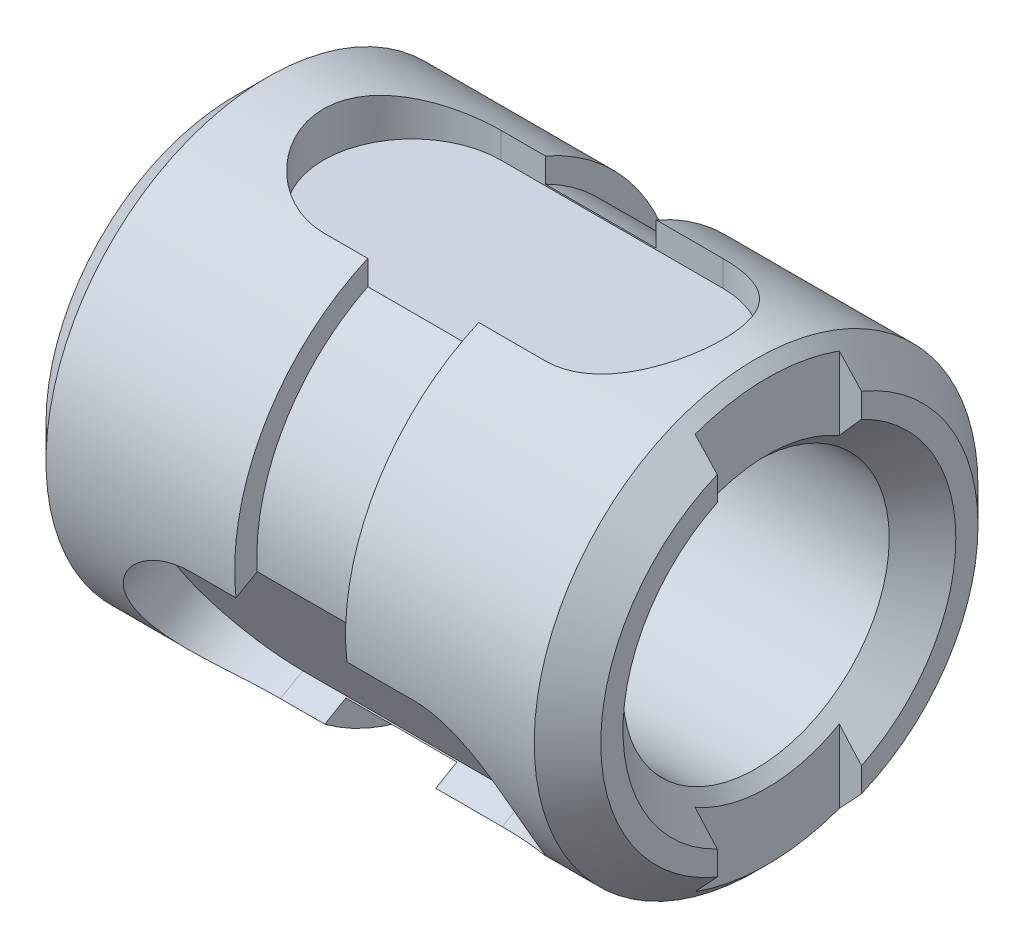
ISO-10303-21;
HEADER;
FILE_DESCRIPTION(('STEP AP214'),'2;1');
FILE_NAME('part.step','',(''),(''),'','','');
FILE_SCHEMA(('AUTOMOTIVE_DESIGN { 1 0 10303 214 1 1 1 1 }'));
ENDSEC;
DATA;
#1=APPLICATION_CONTEXT('core data for automotive mechanical design processes');
#2=APPLICATION_PROTOCOL_DEFINITION('international standard','automotive_design',2000,#1);
#3=PRODUCT_CONTEXT('',#1,'mechanical');
#4=PRODUCT('Part','Part','',(#3));
#5=PRODUCT_RELATED_PRODUCT_CATEGORY('part','',(#4));
#6=PRODUCT_DEFINITION_FORMATION('','',#4);
#7=PRODUCT_DEFINITION_CONTEXT('part definition',#1,'design');
#8=PRODUCT_DEFINITION('design','',#6,#7);
#9=PRODUCT_DEFINITION_SHAPE('','',#8);
#10=(LENGTH_UNIT() NAMED_UNIT(*) SI_UNIT(.MILLI.,.METRE.));
#11=(NAMED_UNIT(*) PLANE_ANGLE_UNIT() SI_UNIT($,.RADIAN.));
#12=(NAMED_UNIT(*) SI_UNIT($,.STERADIAN.) SOLID_ANGLE_UNIT());
#13=UNCERTAINTY_MEASURE_WITH_UNIT(LENGTH_MEASURE(1.E-05),#10,'distance_accuracy_value','');
#14=(GEOMETRIC_REPRESENTATION_CONTEXT(3) GLOBAL_UNCERTAINTY_ASSIGNED_CONTEXT((#13)) GLOBAL_UNIT_ASSIGNED_CONTEXT((#10,
#11,#12)) REPRESENTATION_CONTEXT('',''));
#15=CARTESIAN_POINT('',(0.,0.,0.));
#16=DIRECTION('',(0.,0.,1.));
#17=DIRECTION('',(1.,0.,0.));
#18=AXIS2_PLACEMENT_3D('',#15,#16,#17);
#19=CARTESIAN_POINT('',(0.,8.5,0.));
#20=DIRECTION('',(1.,0.,0.));
#21=DIRECTION('',(0.,0.,-1.));
#22=AXIS2_PLACEMENT_3D('',#19,#20,#21);
#23=PLANE('',#22);
#24=DIRECTION('',(0.,1.,0.));
#25=VECTOR('',#24,1.);
#26=CARTESIAN_POINT('',(0.,8.5,-3.25));
#27=LINE('',#26,#25);
#28=CARTESIAN_POINT('',(0.,-7.8541390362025,-3.25));
#29=VERTEX_POINT('',#28);
#30=CARTESIAN_POINT('',(0.,-6.75925291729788,-3.25));
#31=VERTEX_POINT('',#30);
#32=EDGE_CURVE('E455',#29,#31,#27,.T.);
#33=ORIENTED_EDGE('',*,*,#32,.F.);
#34=CARTESIAN_POINT('',(0.,0.,0.));
#35=DIRECTION('',(1.,0.,0.));
#36=DIRECTION('',(0.,0.,-1.));
#37=AXIS2_PLACEMENT_3D('',#34,#35,#36);
#38=CIRCLE('',#37,8.5);
#39=CARTESIAN_POINT('',(0.,7.8541390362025,-3.25));
#40=VERTEX_POINT('',#39);
#41=EDGE_CURVE('E294',#29,#40,#38,.T.);
#42=ORIENTED_EDGE('',*,*,#41,.T.);
#43=CARTESIAN_POINT('',(0.,6.75925291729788,-3.25));
#44=VERTEX_POINT('',#43);
#45=EDGE_CURVE('E268',#44,#40,#27,.T.);
#46=ORIENTED_EDGE('',*,*,#45,.F.);
#47=CARTESIAN_POINT('',(0.,0.,0.));
#48=DIRECTION('',(1.,0.,0.));
#49=DIRECTION('',(0.,0.,-1.));
#50=AXIS2_PLACEMENT_3D('',#47,#48,#49);
#51=CIRCLE('',#50,7.5);
#52=EDGE_CURVE('E284',#31,#44,#51,.T.);
#53=ORIENTED_EDGE('',*,*,#52,.F.);
#54=EDGE_LOOP('',(#33,#42,#46,#53));
#55=FACE_BOUND('',#54,.T.);
#56=ADVANCED_FACE('F49',(#55),#23,.T.);
#57=CARTESIAN_POINT('',(0.,0.,0.));
#58=DIRECTION('',(1.,0.,0.));
#59=DIRECTION('',(0.,0.,-1.));
#60=AXIS2_PLACEMENT_3D('',#57,#58,#59);
#61=CYLINDRICAL_SURFACE('',#60,9.99999999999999);
#62=CARTESIAN_POINT('',(-15.,0.,0.));
#63=DIRECTION('',(-1.,0.,0.));
#64=DIRECTION('',(0.,0.,1.));
#65=AXIS2_PLACEMENT_3D('',#62,#63,#64);
#66=CIRCLE('',#65,9.99999999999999);
#67=CARTESIAN_POINT('',(-15.,-8.04667731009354,5.93725393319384));
#68=VERTEX_POINT('',#67);
#69=CARTESIAN_POINT('',(-15.,-8.04667731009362,-5.93725393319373));
#70=VERTEX_POINT('',#69);
#71=EDGE_CURVE('E574',#68,#70,#66,.F.);
#72=ORIENTED_EDGE('',*,*,#71,.F.);
#73=DIRECTION('',(1.,0.,0.));
#74=VECTOR('',#73,1.);
#75=CARTESIAN_POINT('',(0.,-8.04667731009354,5.93725393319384));
#76=LINE('',#75,#74);
#77=CARTESIAN_POINT('',(-17.,-8.04667731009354,5.93725393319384));
#78=VERTEX_POINT('',#77);
#79=EDGE_CURVE('E375',#68,#78,#76,.F.);
#80=ORIENTED_EDGE('',*,*,#79,.T.);
#81=CARTESIAN_POINT('',(-17.,-8.04667731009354,5.93725393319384));
#82=CARTESIAN_POINT('',(-17.1076117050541,-8.04668008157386,5.93722681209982));
#83=CARTESIAN_POINT('',(-17.2152113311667,-8.04386424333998,5.94106590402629));
#84=CARTESIAN_POINT('',(-17.4295425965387,-8.03262080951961,5.95627112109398));
#85=CARTESIAN_POINT('',(-17.5362745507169,-8.0241953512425,5.96763437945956));
#86=CARTESIAN_POINT('',(-17.7476936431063,-8.00180218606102,5.99762379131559));
#87=CARTESIAN_POINT('',(-17.8523871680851,-7.98785638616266,6.0162212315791));
#88=CARTESIAN_POINT('',(-18.0594015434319,-7.95447439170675,6.06028858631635));
#89=CARTESIAN_POINT('',(-18.1617222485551,-7.93503786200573,6.08575892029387));
#90=CARTESIAN_POINT('',(-18.4638717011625,-7.86860278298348,6.17174093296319));
#91=CARTESIAN_POINT('',(-18.6593084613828,-7.81343446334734,6.241885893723));
#92=CARTESIAN_POINT('',(-19.0335911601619,-7.68174605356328,6.40324679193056));
#93=CARTESIAN_POINT('',(-19.2124211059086,-7.60520565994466,6.49448275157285));
#94=CARTESIAN_POINT('',(-19.558524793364,-7.42665169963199,6.69806464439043));
#95=CARTESIAN_POINT('',(-19.7247344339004,-7.32353241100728,6.81125366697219));
#96=CARTESIAN_POINT('',(-20.0310805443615,-7.09458871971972,7.04940227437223));
#97=CARTESIAN_POINT('',(-20.1712116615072,-6.96875966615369,7.17436426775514));
#98=CARTESIAN_POINT('',(-20.4268127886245,-6.68991314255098,7.4352458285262));
#99=CARTESIAN_POINT('',(-20.5410896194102,-6.53601784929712,7.57140326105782));
#100=CARTESIAN_POINT('',(-20.7336881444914,-6.20693578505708,7.84343156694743));
#101=CARTESIAN_POINT('',(-20.8120248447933,-6.03175793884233,7.97930253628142));
#102=CARTESIAN_POINT('',(-20.9266824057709,-5.67295092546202,8.23796946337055));
#103=CARTESIAN_POINT('',(-20.9648539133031,-5.49014160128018,8.36107996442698));
#104=CARTESIAN_POINT('',(-21.0040569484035,-5.11385133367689,8.59637662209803));
#105=CARTESIAN_POINT('',(-21.0051016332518,-4.92037419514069,8.70856663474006));
#106=CARTESIAN_POINT('',(-20.9710343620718,-4.5400180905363,8.91247546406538));
#107=CARTESIAN_POINT('',(-20.9379500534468,-4.35337894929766,9.00499018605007));
#108=CARTESIAN_POINT('',(-20.8400129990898,-3.9817869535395,9.17535660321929));
#109=CARTESIAN_POINT('',(-20.7751584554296,-3.79683419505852,9.25320746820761));
#110=CARTESIAN_POINT('',(-20.6147279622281,-3.43138621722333,9.39492486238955));
#111=CARTESIAN_POINT('',(-20.518703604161,-3.25100023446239,9.45856287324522));
#112=CARTESIAN_POINT('',(-20.2990687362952,-2.90286868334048,9.57114803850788));
#113=CARTESIAN_POINT('',(-20.1754485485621,-2.73512757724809,9.62009002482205));
#114=CARTESIAN_POINT('',(-19.8947199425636,-2.40674162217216,9.70764392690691));
#115=CARTESIAN_POINT('',(-19.7359469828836,-2.24728362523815,9.7453678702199));
#116=CARTESIAN_POINT('',(-19.3940078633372,-1.95375725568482,9.80843624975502));
#117=CARTESIAN_POINT('',(-19.2108306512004,-1.81970045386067,9.83377505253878));
#118=CARTESIAN_POINT('',(-18.9183643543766,-1.64026953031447,9.86475286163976));
#119=CARTESIAN_POINT('',(-18.8163281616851,-1.58341812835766,9.87398591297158));
#120=CARTESIAN_POINT('',(-18.6076076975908,-1.47866346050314,9.89021547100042));
#121=CARTESIAN_POINT('',(-18.5009254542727,-1.43075633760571,9.89721294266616));
#122=CARTESIAN_POINT('',(-18.2837710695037,-1.34462420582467,9.9092825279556));
#123=CARTESIAN_POINT('',(-18.1733038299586,-1.30638717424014,9.9143570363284));
#124=CARTESIAN_POINT('',(-17.9493316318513,-1.24012819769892,9.92286200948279));
#125=CARTESIAN_POINT('',(-17.8358280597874,-1.21210167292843,9.92629321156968));
#126=CARTESIAN_POINT('',(-17.6025545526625,-1.16592454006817,9.93182841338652));
#127=CARTESIAN_POINT('',(-17.4827058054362,-1.14816374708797,9.93388045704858));
#128=CARTESIAN_POINT('',(-17.241909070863,-1.12442140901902,9.93658397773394));
#129=CARTESIAN_POINT('',(-17.1209618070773,-1.1184326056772,9.93723631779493));
#130=CARTESIAN_POINT('',(-17.,-1.11847407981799,9.93725393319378));
#131=B_SPLINE_CURVE_WITH_KNOTS('',3,(#81,#82,#83,#84,#85,#86,#87,#88,#89,#90,#91,#92,#93,#94,
#95,#96,#97,#98,#99,#100,#101,#102,#103,#104,#105,#106,#107,#108,#109,#110,#111,#112,#113,#114,
#115,#116,#117,#118,#119,#120,#121,#122,#123,#124,#125,#126,#127,#128,#129,#130),.UNSPECIFIED.,
.F.,.F.,(4,2,2,2,2,2,2,2,2,2,2,2,2,2,2,2,2,2,2,2,2,2,2,2,4),(0.,0.322709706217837,
0.645296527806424,0.966615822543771,1.28795473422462,1.9293660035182,2.57138869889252,
3.24636095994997,3.92147161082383,4.62325717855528,5.32474946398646,5.9922775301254,
6.65956903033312,7.28937830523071,7.91922322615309,8.55856353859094,9.19812842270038,
9.87963749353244,10.5614562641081,10.9125878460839,11.2635676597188,11.614108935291,
11.964492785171,12.3274303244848,12.6901440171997),.UNSPECIFIED.);
#132=CARTESIAN_POINT('',(-17.,-1.11847407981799,9.93725393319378));
#133=VERTEX_POINT('',#132);
#134=EDGE_CURVE('E395',#78,#133,#131,.T.);
#135=ORIENTED_EDGE('',*,*,#134,.T.);
#136=DIRECTION('',(1.,0.,0.));
#137=VECTOR('',#136,1.);
#138=CARTESIAN_POINT('',(0.,-1.11847407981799,9.93725393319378));
#139=LINE('',#138,#137);
#140=CARTESIAN_POINT('',(-15.,-1.11847407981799,9.93725393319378));
#141=VERTEX_POINT('',#140);
#142=EDGE_CURVE('E363',#133,#141,#139,.T.);
#143=ORIENTED_EDGE('',*,*,#142,.T.);
#144=CARTESIAN_POINT('',(-15.,9.16515138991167,4.));
#145=VERTEX_POINT('',#144);
#146=EDGE_CURVE('E578',#145,#141,#66,.F.);
#147=ORIENTED_EDGE('',*,*,#146,.F.);
#148=DIRECTION('',(1.,0.,0.));
#149=VECTOR('',#148,1.);
#150=CARTESIAN_POINT('',(0.,9.16515138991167,4.));
#151=LINE('',#150,#149);
#152=CARTESIAN_POINT('',(-17.,9.16515138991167,4.));
#153=VERTEX_POINT('',#152);
#154=EDGE_CURVE('E325',#145,#153,#151,.F.);
#155=ORIENTED_EDGE('',*,*,#154,.T.);
#156=CARTESIAN_POINT('',(-17.,9.16515138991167,4.));
#157=CARTESIAN_POINT('',(-17.1076117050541,9.16512928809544,4.00001596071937));
#158=CARTESIAN_POINT('',(-17.2152113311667,9.16704612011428,3.99565782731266));
#159=CARTESIAN_POINT('',(-17.4295425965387,9.17459250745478,3.9783181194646));
#160=CARTESIAN_POINT('',(-17.5362745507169,9.18022064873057,3.96533982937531));
#161=CARTESIAN_POINT('',(-17.7476936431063,9.19499565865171,3.93095207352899));
#162=CARTESIAN_POINT('',(-17.8523871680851,9.2041286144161,3.90957593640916));
#163=CARTESIAN_POINT('',(-18.0594015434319,9.22560106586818,3.85863260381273));
#164=CARTESIAN_POINT('',(-18.1617222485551,9.23794075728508,3.82906490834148));
#165=CARTESIAN_POINT('',(-18.4638717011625,9.27918582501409,3.72853943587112));
#166=CARTESIAN_POINT('',(-18.6593084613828,9.3123489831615,3.64568978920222));
#167=CARTESIAN_POINT('',(-19.0335911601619,9.38624741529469,3.45096383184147));
#168=CARTESIAN_POINT('',(-19.2124211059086,9.42698987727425,3.33905992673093));
#169=CARTESIAN_POINT('',(-19.558524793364,9.51401998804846,3.08263671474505));
#170=CARTESIAN_POINT('',(-19.7247344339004,9.56048491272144,2.93673827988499));
#171=CARTESIAN_POINT('',(-20.0310805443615,9.65225581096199,2.61939292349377));
#172=CARTESIAN_POINT('',(-20.1712116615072,9.69756154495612,2.44794076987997));
#173=CARTESIAN_POINT('',(-20.4268127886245,9.78406834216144,2.07601181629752));
#174=CARTESIAN_POINT('',(-20.5410896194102,9.82503649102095,1.87465586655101));
#175=CARTESIAN_POINT('',(-20.7336881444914,9.89607888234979,1.45364828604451));
#176=CARTESIAN_POINT('',(-20.8120248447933,9.92615767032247,1.2340043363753));
#177=CARTESIAN_POINT('',(-20.9266824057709,9.97076629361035,0.793934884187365));
#178=CARTESIAN_POINT('',(-20.9648539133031,9.98597845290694,0.574062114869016));
#179=CARTESIAN_POINT('',(-21.0040569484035,10.001606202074,0.130536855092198));
#180=CARTESIAN_POINT('',(-21.0051016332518,10.0020270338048,-0.0931142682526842));
#181=CARTESIAN_POINT('',(-20.9710343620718,9.98843920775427,-0.524466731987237));
#182=CARTESIAN_POINT('',(-20.9379500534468,9.97523973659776,-0.732358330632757));
#183=CARTESIAN_POINT('',(-20.8400129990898,9.93698538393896,-1.13934964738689));
#184=CARTESIAN_POINT('',(-20.7751584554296,9.91192983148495,-1.33844886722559));
#185=CARTESIAN_POINT('',(-20.6147279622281,9.85193670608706,-1.72579479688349));
#186=CARTESIAN_POINT('',(-20.518703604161,9.8168558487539,-1.91383264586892));
#187=CARTESIAN_POINT('',(-20.2990687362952,9.74029168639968,-2.27161599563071));
#188=CARTESIAN_POINT('',(-20.1754485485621,9.69880613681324,-2.4413550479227));
#189=CARTESIAN_POINT('',(-19.8947199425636,9.61043706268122,-2.76952257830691));
#190=CARTESIAN_POINT('',(-19.7359469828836,9.56337795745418,-2.92647922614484));
#191=CARTESIAN_POINT('',(-19.3940078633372,9.47123359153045,-3.21221470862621));
#192=CARTESIAN_POINT('',(-19.2108306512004,9.42614923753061,-3.34098070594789));
#193=CARTESIAN_POINT('',(-18.9183643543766,9.36326134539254,-3.51186134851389));
#194=CARTESIAN_POINT('',(-18.8163281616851,9.34283170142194,-3.56571263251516));
#195=CARTESIAN_POINT('',(-18.6076076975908,9.30450957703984,-3.6645476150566));
#196=CARTESIAN_POINT('',(-18.5009254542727,9.28661600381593,-3.70953513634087));
#197=CARTESIAN_POINT('',(-18.2837710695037,9.2540025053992,-3.79016254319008));
#198=CARTESIAN_POINT('',(-18.1733038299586,9.2392786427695,-3.82581403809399));
#199=CARTESIAN_POINT('',(-17.9493316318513,9.21351467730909,-3.88744848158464));
#200=CARTESIAN_POINT('',(-17.8358280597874,9.20247292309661,-3.91343576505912));
#201=CARTESIAN_POINT('',(-17.6025545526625,9.18417798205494,-3.95619393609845));
#202=CARTESIAN_POINT('',(-17.4827058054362,9.17707470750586,-3.9726012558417));
#203=CARTESIAN_POINT('',(-17.241909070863,9.16754485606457,-3.99451448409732));
#204=CARTESIAN_POINT('',(-17.1209618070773,9.16511539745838,-4.0000271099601));
#205=CARTESIAN_POINT('',(-17.,9.16515138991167,-4.));
#206=B_SPLINE_CURVE_WITH_KNOTS('',3,(#156,#157,#158,#159,#160,#161,#162,#163,#164,#165,#166,
#167,#168,#169,#170,#171,#172,#173,#174,#175,#176,#177,#178,#179,#180,#181,#182,#183,#184,#185,
#186,#187,#188,#189,#190,#191,#192,#193,#194,#195,#196,#197,#198,#199,#200,#201,#202,#203,#204,
#205),.UNSPECIFIED.,.F.,.F.,(4,2,2,2,2,2,2,2,2,2,2,2,2,2,2,2,2,2,2,2,2,2,2,2,4),(0.,
0.322709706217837,0.645296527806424,0.966615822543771,1.28795473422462,1.9293660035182,
2.57138869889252,3.24636095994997,3.92147161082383,4.62325717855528,5.32474946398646,
5.9922775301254,6.65956903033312,7.28937830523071,7.91922322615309,8.55856353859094,
9.19812842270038,9.87963749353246,10.5614562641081,10.9125878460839,11.2635676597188,
11.614108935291,11.964492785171,12.3274303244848,12.6901440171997),.UNSPECIFIED.);
#207=CARTESIAN_POINT('',(-17.,9.16515138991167,-4.));
#208=VERTEX_POINT('',#207);
#209=EDGE_CURVE('E349',#153,#208,#206,.T.);
#210=ORIENTED_EDGE('',*,*,#209,.T.);
#211=DIRECTION('',(1.,0.,0.));
#212=VECTOR('',#211,1.);
#213=CARTESIAN_POINT('',(0.,9.16515138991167,-4.));
#214=LINE('',#213,#212);
#215=CARTESIAN_POINT('',(-15.,9.16515138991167,-4.));
#216=VERTEX_POINT('',#215);
#217=EDGE_CURVE('E358',#208,#216,#214,.T.);
#218=ORIENTED_EDGE('',*,*,#217,.T.);
#219=CARTESIAN_POINT('',(-15.,-1.11847407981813,-9.93725393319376));
#220=VERTEX_POINT('',#219);
#221=EDGE_CURVE('E579',#220,#216,#66,.F.);
#222=ORIENTED_EDGE('',*,*,#221,.F.);
#223=DIRECTION('',(1.,0.,0.));
#224=VECTOR('',#223,1.);
#225=CARTESIAN_POINT('',(0.,-1.11847407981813,-9.93725393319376));
#226=LINE('',#225,#224);
#227=CARTESIAN_POINT('',(-17.,-1.11847407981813,-9.93725393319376));
#228=VERTEX_POINT('',#227);
#229=EDGE_CURVE('E416',#220,#228,#226,.F.);
#230=ORIENTED_EDGE('',*,*,#229,.T.);
#231=CARTESIAN_POINT('',(-17.,-1.11847407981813,-9.93725393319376));
#232=CARTESIAN_POINT('',(-17.1076117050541,-1.11844920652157,-9.93724277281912));
#233=CARTESIAN_POINT('',(-17.2152113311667,-1.12318187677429,-9.93672373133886));
#234=CARTESIAN_POINT('',(-17.4295425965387,-1.14197169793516,-9.9345892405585));
#235=CARTESIAN_POINT('',(-17.5362745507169,-1.15602529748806,-9.93297420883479));
#236=CARTESIAN_POINT('',(-17.7476936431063,-1.19319347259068,-9.9285758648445));
#237=CARTESIAN_POINT('',(-17.8523871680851,-1.21627222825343,-9.92579716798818));
#238=CARTESIAN_POINT('',(-18.0594015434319,-1.27112667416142,-9.91892119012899));
#239=CARTESIAN_POINT('',(-18.1617222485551,-1.30290289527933,-9.91482382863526));
#240=CARTESIAN_POINT('',(-18.4638717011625,-1.41058304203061,-9.90028036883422));
#241=CARTESIAN_POINT('',(-18.6593084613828,-1.49891451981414,-9.88757568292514));
#242=CARTESIAN_POINT('',(-19.0335911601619,-1.70450136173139,-9.85421062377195));
#243=CARTESIAN_POINT('',(-19.2124211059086,-1.82178421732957,-9.83354267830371));
#244=CARTESIAN_POINT('',(-19.5585247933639,-2.08736828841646,-9.78070135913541));
#245=CARTESIAN_POINT('',(-19.7247344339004,-2.23695250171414,-9.74799194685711));
#246=CARTESIAN_POINT('',(-20.0310805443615,-2.55766709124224,-9.66879519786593));
#247=CARTESIAN_POINT('',(-20.1712116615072,-2.72880187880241,-9.62230503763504));
#248=CARTESIAN_POINT('',(-20.4268127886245,-3.09415519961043,-9.51125764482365));
#249=CARTESIAN_POINT('',(-20.5410896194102,-3.28901864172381,-9.44605912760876));
#250=CARTESIAN_POINT('',(-20.7336881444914,-3.68914309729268,-9.29707985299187));
#251=CARTESIAN_POINT('',(-20.8120248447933,-3.89439973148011,-9.21330687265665));
#252=CARTESIAN_POINT('',(-20.9266824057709,-4.29781536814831,-9.03190434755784));
#253=CARTESIAN_POINT('',(-20.9648539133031,-4.49583685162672,-8.93514207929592));
#254=CARTESIAN_POINT('',(-21.0040569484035,-4.88775486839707,-8.72691347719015));
#255=CARTESIAN_POINT('',(-21.0051016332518,-5.08165283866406,-8.6154523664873));
#256=CARTESIAN_POINT('',(-20.9710343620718,-5.44842111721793,-8.38800873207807));
#257=CARTESIAN_POINT('',(-20.9379500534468,-5.62186078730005,-8.27263185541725));
#258=CARTESIAN_POINT('',(-20.8400129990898,-5.95519843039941,-8.03600695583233));
#259=CARTESIAN_POINT('',(-20.7751584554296,-6.11509563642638,-7.91475860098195));
#260=CARTESIAN_POINT('',(-20.6147279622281,-6.42055048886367,-7.669130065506));
#261=CARTESIAN_POINT('',(-20.518703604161,-6.56585561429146,-7.54473022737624));
#262=CARTESIAN_POINT('',(-20.2990687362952,-6.83742300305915,-7.29953204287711));
#263=CARTESIAN_POINT('',(-20.1754485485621,-6.96367855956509,-7.17873497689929));
#264=CARTESIAN_POINT('',(-19.8947199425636,-7.203695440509,-6.93812134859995));
#265=CARTESIAN_POINT('',(-19.7359469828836,-7.31609433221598,-6.81888864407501));
#266=CARTESIAN_POINT('',(-19.3940078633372,-7.51747633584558,-6.59622154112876));
#267=CARTESIAN_POINT('',(-19.2108306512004,-7.60644878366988,-6.49279434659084));
#268=CARTESIAN_POINT('',(-18.9183643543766,-7.72299181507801,-6.35289151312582));
#269=CARTESIAN_POINT('',(-18.8163281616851,-7.75941357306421,-6.30827328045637));
#270=CARTESIAN_POINT('',(-18.6076076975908,-7.82584611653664,-6.22566785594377));
#271=CARTESIAN_POINT('',(-18.5009254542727,-7.85585966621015,-6.18767780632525));
#272=CARTESIAN_POINT('',(-18.2837710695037,-7.90937829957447,-6.11911998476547));
#273=CARTESIAN_POINT('',(-18.1733038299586,-7.9328914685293,-6.08854299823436));
#274=CARTESIAN_POINT('',(-17.9493316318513,-7.97338647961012,-6.0354135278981));
#275=CARTESIAN_POINT('',(-17.8358280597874,-7.99037125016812,-6.01285744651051));
#276=CARTESIAN_POINT('',(-17.6025545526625,-8.01825344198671,-5.97563447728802));
#277=CARTESIAN_POINT('',(-17.4827058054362,-8.02891096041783,-5.96127920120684));
#278=CARTESIAN_POINT('',(-17.241909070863,-8.04312344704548,-5.94206949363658));
#279=CARTESIAN_POINT('',(-17.1209618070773,-8.04668279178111,-5.93720920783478));
#280=CARTESIAN_POINT('',(-17.,-8.04667731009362,-5.93725393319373));
#281=B_SPLINE_CURVE_WITH_KNOTS('',3,(#231,#232,#233,#234,#235,#236,#237,#238,#239,#240,#241,
#242,#243,#244,#245,#246,#247,#248,#249,#250,#251,#252,#253,#254,#255,#256,#257,#258,#259,#260,
#261,#262,#263,#264,#265,#266,#267,#268,#269,#270,#271,#272,#273,#274,#275,#276,#277,#278,#279,
#280),.UNSPECIFIED.,.F.,.F.,(4,2,2,2,2,2,2,2,2,2,2,2,2,2,2,2,2,2,2,2,2,2,2,2,4),(0.,
0.322709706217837,0.645296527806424,0.966615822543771,1.28795473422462,1.92936600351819,
2.57138869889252,3.24636095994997,3.92147161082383,4.62325717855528,5.32474946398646,
5.9922775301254,6.65956903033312,7.28937830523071,7.91922322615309,8.55856353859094,
9.19812842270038,9.87963749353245,10.5614562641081,10.9125878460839,11.2635676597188,
11.614108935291,11.964492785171,12.3274303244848,12.6901440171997),.UNSPECIFIED.);
#282=CARTESIAN_POINT('',(-17.,-8.04667731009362,-5.93725393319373));
#283=VERTEX_POINT('',#282);
#284=EDGE_CURVE('E436',#228,#283,#281,.T.);
#285=ORIENTED_EDGE('',*,*,#284,.T.);
#286=DIRECTION('',(1.,0.,0.));
#287=VECTOR('',#286,1.);
#288=CARTESIAN_POINT('',(0.,-8.04667731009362,-5.93725393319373));
#289=LINE('',#288,#287);
#290=EDGE_CURVE('E404',#283,#70,#289,.T.);
#291=ORIENTED_EDGE('',*,*,#290,.T.);
#292=EDGE_LOOP('',(#72,#80,#135,#143,#147,#155,#210,#218,#222,#230,#285,#291));
#293=FACE_BOUND('',#292,.T.);
#294=CARTESIAN_POINT('',(-23.5,0.,0.));
#295=DIRECTION('',(1.,0.,0.));
#296=DIRECTION('',(0.,0.,-1.));
#297=AXIS2_PLACEMENT_3D('',#294,#295,#296);
#298=CIRCLE('',#297,9.99999999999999);
#299=CARTESIAN_POINT('',(-23.5,0.,-9.99999999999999));
#300=VERTEX_POINT('',#299);
#301=EDGE_CURVE('E308',#300,#300,#298,.T.);
#302=ORIENTED_EDGE('',*,*,#301,.T.);
#303=EDGE_LOOP('',(#302));
#304=FACE_BOUND('',#303,.T.);
#305=ADVANCED_FACE('F706',(#293,#304),#61,.T.);
#306=CARTESIAN_POINT('',(-10.,0.,0.));
#307=DIRECTION('',(1.,0.,0.));
#308=DIRECTION('',(0.,0.,-1.));
#309=AXIS2_PLACEMENT_3D('',#306,#307,#308);
#310=CIRCLE('',#309,9.99999999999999);
#311=CARTESIAN_POINT('',(-10.,-8.04667731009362,-5.93725393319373));
#312=VERTEX_POINT('',#311);
#313=CARTESIAN_POINT('',(-10.,-8.04667731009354,5.93725393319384));
#314=VERTEX_POINT('',#313);
#315=EDGE_CURVE('E538',#312,#314,#310,.F.);
#316=ORIENTED_EDGE('',*,*,#315,.F.);
#317=CARTESIAN_POINT('',(-7.,-8.04667731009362,-5.93725393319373));
#318=VERTEX_POINT('',#317);
#319=EDGE_CURVE('E403',#312,#318,#289,.T.);
#320=ORIENTED_EDGE('',*,*,#319,.T.);
#321=CARTESIAN_POINT('',(-7.,-8.04667731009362,-5.93725393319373));
#322=CARTESIAN_POINT('',(-6.89282250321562,-8.04667700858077,-5.93725505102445));
#323=CARTESIAN_POINT('',(-6.78561214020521,-8.04388473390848,-5.94104449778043));
#324=CARTESIAN_POINT('',(-6.57196790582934,-8.03272250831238,-5.95612741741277));
#325=CARTESIAN_POINT('',(-6.46553455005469,-8.0243491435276,-5.96742548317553));
#326=CARTESIAN_POINT('',(-6.25406404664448,-8.00202550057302,-5.99732757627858));
#327=CARTESIAN_POINT('',(-6.14903011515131,-7.98806410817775,-6.01594616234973));
#328=CARTESIAN_POINT('',(-5.94131240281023,-7.95461015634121,-6.06011020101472));
#329=CARTESIAN_POINT('',(-5.83862961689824,-7.93511530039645,-6.08565852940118));
#330=CARTESIAN_POINT('',(-5.53601027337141,-7.86857668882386,-6.17177503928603));
#331=CARTESIAN_POINT('',(-5.34046207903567,-7.81336957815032,-6.24196852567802));
#332=CARTESIAN_POINT('',(-4.96619873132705,-7.68165622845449,-6.40335374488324));
#333=CARTESIAN_POINT('',(-4.78747991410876,-7.60515463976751,-6.49454089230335));
#334=CARTESIAN_POINT('',(-4.44148818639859,-7.42665835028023,-6.69805709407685));
#335=CARTESIAN_POINT('',(-4.27528956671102,-7.32354729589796,-6.81123734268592));
#336=CARTESIAN_POINT('',(-3.96893959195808,-7.09460682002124,-7.04938428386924));
#337=CARTESIAN_POINT('',(-3.82879733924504,-6.96876948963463,-7.17435507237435));
#338=CARTESIAN_POINT('',(-3.57318789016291,-6.68991387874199,-7.43524514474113));
#339=CARTESIAN_POINT('',(-3.45891158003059,-6.53601946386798,-7.57140183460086));
#340=CARTESIAN_POINT('',(-3.26631268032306,-6.20693762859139,-7.843430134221));
#341=CARTESIAN_POINT('',(-3.18797546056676,-6.03175890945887,-7.97930183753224));
#342=CARTESIAN_POINT('',(-3.07331707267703,-5.67294927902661,-8.23797064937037));
#343=CARTESIAN_POINT('',(-3.03514538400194,-5.49013815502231,-8.36108227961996));
#344=CARTESIAN_POINT('',(-2.99594301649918,-5.11384770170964,-8.59637873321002));
#345=CARTESIAN_POINT('',(-2.9948984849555,-4.92037237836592,-8.70856761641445));
#346=CARTESIAN_POINT('',(-3.02896554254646,-4.54001962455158,-8.91247463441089));
#347=CARTESIAN_POINT('',(-3.06204954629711,-4.35338201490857,-9.00498864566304));
#348=CARTESIAN_POINT('',(-3.1599857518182,-3.98179014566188,-9.17535527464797));
#349=CARTESIAN_POINT('',(-3.22484028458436,-3.79683601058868,-9.25320681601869));
#350=CARTESIAN_POINT('',(-3.38527296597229,-3.43138517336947,-9.39492521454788));
#351=CARTESIAN_POINT('',(-3.48129942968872,-3.25099766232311,-9.45856361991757));
#352=CARTESIAN_POINT('',(-3.70093001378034,-2.90286842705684,-9.57114820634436));
#353=CARTESIAN_POINT('',(-3.82454358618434,-2.73513106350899,-9.62008933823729));
#354=CARTESIAN_POINT('',(-4.1052982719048,-2.40672640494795,-9.70764772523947));
#355=CARTESIAN_POINT('',(-4.26410778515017,-2.24724633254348,-9.74537620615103));
#356=CARTESIAN_POINT('',(-4.60598114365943,-1.95375696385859,-9.80843598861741));
#357=CARTESIAN_POINT('',(-4.78905289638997,-1.81975600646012,-9.83376323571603));
#358=CARTESIAN_POINT('',(-5.18083804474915,-1.57942423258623,-9.8752597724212));
#359=CARTESIAN_POINT('',(-5.39012966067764,-1.47398191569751,-9.89115017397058));
#360=CARTESIAN_POINT('',(-5.8244309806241,-1.30169331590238,-9.91530399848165));
#361=CARTESIAN_POINT('',(-6.04943036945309,-1.23482196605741,-9.92357237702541));
#362=CARTESIAN_POINT('',(-6.49407155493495,-1.14679067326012,-9.9341195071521));
#363=CARTESIAN_POINT('',(-6.71320089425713,-1.12308768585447,-9.93673332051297));
#364=CARTESIAN_POINT('',(-7.1521544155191,-1.11508906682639,-9.93763622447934));
#365=CARTESIAN_POINT('',(-7.37197836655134,-1.13078148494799,-9.93592662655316));
#366=CARTESIAN_POINT('',(-7.79291786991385,-1.19848773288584,-9.92797322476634));
#367=CARTESIAN_POINT('',(-7.9943858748,-1.24838195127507,-9.92199321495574));
#368=CARTESIAN_POINT('',(-8.38657680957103,-1.37951620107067,-9.90460889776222));
#369=CARTESIAN_POINT('',(-8.57729734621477,-1.46076318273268,-9.89320338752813));
#370=CARTESIAN_POINT('',(-8.95120471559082,-1.65474602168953,-9.86264674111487));
#371=CARTESIAN_POINT('',(-9.13377237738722,-1.76862524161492,-9.84320025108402));
#372=CARTESIAN_POINT('',(-9.47896597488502,-2.02170175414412,-9.79435105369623));
#373=CARTESIAN_POINT('',(-9.64158374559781,-2.16090935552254,-9.76494428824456));
#374=CARTESIAN_POINT('',(-9.95474681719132,-2.47101425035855,-9.69129907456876));
#375=CARTESIAN_POINT('',(-10.1035131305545,-2.64349278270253,-9.64612552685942));
#376=CARTESIAN_POINT('',(-10.3703541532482,-3.00624206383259,-9.53929852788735));
#377=CARTESIAN_POINT('',(-10.4884276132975,-3.19651353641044,-9.47764440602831));
#378=CARTESIAN_POINT('',(-10.6900952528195,-3.58835266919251,-9.33632887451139));
#379=CARTESIAN_POINT('',(-10.7736976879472,-3.78991761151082,-9.25667178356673));
#380=CARTESIAN_POINT('',(-10.9030977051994,-4.19715845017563,-9.07926604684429));
#381=CARTESIAN_POINT('',(-10.9489158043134,-4.40283205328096,-8.98152725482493));
#382=CARTESIAN_POINT('',(-10.999009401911,-4.79745795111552,-8.77670695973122));
#383=CARTESIAN_POINT('',(-11.0058002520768,-4.98662570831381,-8.67065105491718));
#384=CARTESIAN_POINT('',(-10.9842890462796,-5.35614636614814,-8.44738229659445));
#385=CARTESIAN_POINT('',(-10.9559923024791,-5.53650059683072,-8.33017113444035));
#386=CARTESIAN_POINT('',(-10.8669064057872,-5.87814166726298,-8.09255641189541));
#387=CARTESIAN_POINT('',(-10.8071420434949,-6.03984403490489,-7.97236151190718));
#388=CARTESIAN_POINT('',(-10.6578944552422,-6.34716844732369,-7.72992882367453));
#389=CARTESIAN_POINT('',(-10.568405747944,-6.49278751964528,-7.60769066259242));
#390=CARTESIAN_POINT('',(-10.3577933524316,-6.77193212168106,-7.36051830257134));
#391=CARTESIAN_POINT('',(-10.2354464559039,-6.90463887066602,-7.23570366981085));
#392=CARTESIAN_POINT('',(-9.96442391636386,-7.1490599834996,-6.99431911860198));
#393=CARTESIAN_POINT('',(-9.81573737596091,-7.26076561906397,-6.87775264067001));
#394=CARTESIAN_POINT('',(-9.48536576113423,-7.46877831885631,-6.6514980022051));
#395=CARTESIAN_POINT('',(-9.30220770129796,-7.56370402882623,-6.54268237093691));
#396=CARTESIAN_POINT('',(-8.91413027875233,-7.72864090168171,-6.34701066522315));
#397=CARTESIAN_POINT('',(-8.7092083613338,-7.79864913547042,-6.26015717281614));
#398=CARTESIAN_POINT('',(-8.30187605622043,-7.90808087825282,-6.12122755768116));
#399=CARTESIAN_POINT('',(-8.10089232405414,-7.94968618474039,-6.06672898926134));
#400=CARTESIAN_POINT('',(-7.79336104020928,-7.99593297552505,-6.00546952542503));
#401=CARTESIAN_POINT('',(-7.68992696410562,-8.00865129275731,-5.98846989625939));
#402=CARTESIAN_POINT('',(-7.48164307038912,-8.0287087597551,-5.96155447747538));
#403=CARTESIAN_POINT('',(-7.37679411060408,-8.03605103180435,-5.95163457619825));
#404=CARTESIAN_POINT('',(-7.22644940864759,-8.04268728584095,-5.94265836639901));
#405=CARTESIAN_POINT('',(-7.18120016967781,-8.04418322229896,-5.94063287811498));
#406=CARTESIAN_POINT('',(-7.09063591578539,-8.0461783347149,-5.93793037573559));
#407=CARTESIAN_POINT('',(-7.04532089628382,-8.04667743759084,-5.93725346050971));
#408=CARTESIAN_POINT('',(-7.,-8.04667731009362,-5.93725393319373));
#409=B_SPLINE_CURVE_WITH_KNOTS('',3,(#321,#322,#323,#324,#325,#326,#327,#328,#329,#330,#331,
#332,#333,#334,#335,#336,#337,#338,#339,#340,#341,#342,#343,#344,#345,#346,#347,#348,#349,#350,
#351,#352,#353,#354,#355,#356,#357,#358,#359,#360,#361,#362,#363,#364,#365,#366,#367,#368,#369,
#370,#371,#372,#373,#374,#375,#376,#377,#378,#379,#380,#381,#382,#383,#384,#385,#386,#387,#388,
#389,#390,#391,#392,#393,#394,#395,#396,#397,#398,#399,#400,#401,#402,#403,#404,#405,#406,#407,
#408),.UNSPECIFIED.,.T.,.F.,(4,2,2,2,2,2,2,2,2,2,2,2,2,2,2,2,2,2,2,2,2,2,2,2,2,2,2,2,2,2,2,2,2,
2,2,2,2,2,2,2,2,2,2,4),(0.,0.321486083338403,0.643168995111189,0.965494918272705,
1.28795480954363,1.92974178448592,2.57138871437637,3.24631250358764,3.92147162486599,
4.62325351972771,5.32474947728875,5.99228379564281,6.65956904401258,7.28937303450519,
7.91922324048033,8.5585661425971,9.19812843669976,9.87968101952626,10.5614562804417,
11.2624893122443,11.9630662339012,12.6208430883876,13.2784204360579,13.898545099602,
14.5188073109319,15.1642232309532,15.8099024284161,16.5032748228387,17.1966754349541,
17.8899098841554,18.5827676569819,19.2304209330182,19.8779761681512,20.5056400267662,
21.1334196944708,21.7889411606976,22.4447344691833,23.1411252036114,23.8375977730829,
24.4715333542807,24.7879924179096,25.1042675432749,25.240200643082,25.3761437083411),.UNSPECIFIED.);
#410=CARTESIAN_POINT('',(-7.,-1.11847407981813,-9.93725393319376));
#411=VERTEX_POINT('',#410);
#412=EDGE_CURVE('E408',#318,#411,#409,.T.);
#413=ORIENTED_EDGE('',*,*,#412,.T.);
#414=CARTESIAN_POINT('',(-10.,-1.11847407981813,-9.93725393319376));
#415=VERTEX_POINT('',#414);
#416=EDGE_CURVE('E417',#411,#415,#226,.F.);
#417=ORIENTED_EDGE('',*,*,#416,.T.);
#418=CARTESIAN_POINT('',(-10.,9.16515138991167,-4.));
#419=VERTEX_POINT('',#418);
#420=EDGE_CURVE('E543',#419,#415,#310,.F.);
#421=ORIENTED_EDGE('',*,*,#420,.F.);
#422=CARTESIAN_POINT('',(-7.,9.16515138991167,-4.));
#423=VERTEX_POINT('',#422);
#424=EDGE_CURVE('E357',#419,#423,#214,.T.);
#425=ORIENTED_EDGE('',*,*,#424,.T.);
#426=CARTESIAN_POINT('',(-7.,9.16515138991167,-4.));
#427=CARTESIAN_POINT('',(-6.89238829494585,9.16512928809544,-4.00001596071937));
#428=CARTESIAN_POINT('',(-6.7847886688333,9.16704612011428,-3.99565782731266));
#429=CARTESIAN_POINT('',(-6.57045740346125,9.17459250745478,-3.9783181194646));
#430=CARTESIAN_POINT('',(-6.4637254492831,9.18022064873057,-3.96533982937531));
#431=CARTESIAN_POINT('',(-6.25230635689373,9.19499565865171,-3.93095207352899));
#432=CARTESIAN_POINT('',(-6.14761283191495,9.2041286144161,-3.90957593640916));
#433=CARTESIAN_POINT('',(-5.94059845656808,9.22560106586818,-3.85863260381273));
#434=CARTESIAN_POINT('',(-5.83827775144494,9.23794075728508,-3.82906490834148));
#435=CARTESIAN_POINT('',(-5.53612829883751,9.27918582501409,-3.72853943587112));
#436=CARTESIAN_POINT('',(-5.34069153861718,9.3123489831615,-3.64568978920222));
#437=CARTESIAN_POINT('',(-4.96640883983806,9.38624741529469,-3.45096383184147));
#438=CARTESIAN_POINT('',(-4.78757889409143,9.42698987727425,-3.33905992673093));
#439=CARTESIAN_POINT('',(-4.44147520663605,9.51401998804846,-3.08263671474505));
#440=CARTESIAN_POINT('',(-4.2752655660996,9.56048491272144,-2.936738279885));
#441=CARTESIAN_POINT('',(-3.96891945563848,9.65225581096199,-2.61939292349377));
#442=CARTESIAN_POINT('',(-3.82878833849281,9.69756154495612,-2.44794076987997));
#443=CARTESIAN_POINT('',(-3.57318721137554,9.78406834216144,-2.07601181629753));
#444=CARTESIAN_POINT('',(-3.45891038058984,9.82503649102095,-1.87465586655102));
#445=CARTESIAN_POINT('',(-3.26631185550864,9.89607888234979,-1.45364828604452));
#446=CARTESIAN_POINT('',(-3.18797515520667,9.92615767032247,-1.2340043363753));
#447=CARTESIAN_POINT('',(-3.07331759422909,9.97076629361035,-0.793934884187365));
#448=CARTESIAN_POINT('',(-3.03514608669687,9.98597845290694,-0.574062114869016));
#449=CARTESIAN_POINT('',(-2.99594305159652,10.001606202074,-0.130536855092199));
#450=CARTESIAN_POINT('',(-2.99489836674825,10.0020270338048,0.0931142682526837));
#451=CARTESIAN_POINT('',(-3.02896563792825,9.98843920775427,0.524466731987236));
#452=CARTESIAN_POINT('',(-3.06204994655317,9.97523973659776,0.732358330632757));
#453=CARTESIAN_POINT('',(-3.15998700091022,9.93698538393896,1.13934964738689));
#454=CARTESIAN_POINT('',(-3.22484154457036,9.91192983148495,1.33844886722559));
#455=CARTESIAN_POINT('',(-3.38527203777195,9.85193670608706,1.72579479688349));
#456=CARTESIAN_POINT('',(-3.48129639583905,9.8168558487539,1.91383264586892));
#457=CARTESIAN_POINT('',(-3.7009312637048,9.74029168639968,2.27161599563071));
#458=CARTESIAN_POINT('',(-3.82455145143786,9.69880613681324,2.4413550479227));
#459=CARTESIAN_POINT('',(-4.10528005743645,9.61043706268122,2.76952257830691));
#460=CARTESIAN_POINT('',(-4.26405301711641,9.56337795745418,2.92647922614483));
#461=CARTESIAN_POINT('',(-4.6059921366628,9.47123359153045,3.2122147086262));
#462=CARTESIAN_POINT('',(-4.78916934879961,9.42614923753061,3.34098070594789));
#463=CARTESIAN_POINT('',(-5.08163564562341,9.36326134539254,3.51186134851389));
#464=CARTESIAN_POINT('',(-5.18367183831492,9.34283170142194,3.56571263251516));
#465=CARTESIAN_POINT('',(-5.39239230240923,9.30450957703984,3.6645476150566));
#466=CARTESIAN_POINT('',(-5.49907454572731,9.28661600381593,3.70953513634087));
#467=CARTESIAN_POINT('',(-5.71622893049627,9.2540025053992,3.79016254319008));
#468=CARTESIAN_POINT('',(-5.82669617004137,9.2392786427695,3.82581403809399));
#469=CARTESIAN_POINT('',(-6.05066836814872,9.21351467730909,3.88744848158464));
#470=CARTESIAN_POINT('',(-6.16417194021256,9.20247292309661,3.91343576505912));
#471=CARTESIAN_POINT('',(-6.39744544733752,9.18417798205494,3.95619393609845));
#472=CARTESIAN_POINT('',(-6.51729419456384,9.17707470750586,3.9726012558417));
#473=CARTESIAN_POINT('',(-6.75809092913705,9.16754485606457,3.99451448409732));
#474=CARTESIAN_POINT('',(-6.87903819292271,9.16511539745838,4.0000271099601));
#475=CARTESIAN_POINT('',(-7.,9.16515138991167,4.));
#476=B_SPLINE_CURVE_WITH_KNOTS('',3,(#426,#427,#428,#429,#430,#431,#432,#433,#434,#435,#436,
#437,#438,#439,#440,#441,#442,#443,#444,#445,#446,#447,#448,#449,#450,#451,#452,#453,#454,#455,
#456,#457,#458,#459,#460,#461,#462,#463,#464,#465,#466,#467,#468,#469,#470,#471,#472,#473,#474,
#475),.UNSPECIFIED.,.F.,.F.,(4,2,2,2,2,2,2,2,2,2,2,2,2,2,2,2,2,2,2,2,2,2,2,2,4),(0.,
0.322709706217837,0.645296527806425,0.966615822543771,1.28795473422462,1.9293660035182,
2.57138869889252,3.24636095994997,3.92147161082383,4.62325717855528,5.32474946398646,
5.9922775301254,6.65956903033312,7.28937830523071,7.91922322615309,8.55856353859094,
9.19812842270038,9.87963749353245,10.5614562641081,10.9125878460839,11.2635676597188,
11.614108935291,11.964492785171,12.3274303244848,12.6901440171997),.UNSPECIFIED.);
#477=CARTESIAN_POINT('',(-7.,9.16515138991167,4.));
#478=VERTEX_POINT('',#477);
#479=EDGE_CURVE('E316',#423,#478,#476,.T.);
#480=ORIENTED_EDGE('',*,*,#479,.T.);
#481=CARTESIAN_POINT('',(-10.,9.16515138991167,4.));
#482=VERTEX_POINT('',#481);
#483=EDGE_CURVE('E326',#478,#482,#151,.F.);
#484=ORIENTED_EDGE('',*,*,#483,.T.);
#485=CARTESIAN_POINT('',(-10.,-1.11847407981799,9.93725393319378));
#486=VERTEX_POINT('',#485);
#487=EDGE_CURVE('E542',#486,#482,#310,.F.);
#488=ORIENTED_EDGE('',*,*,#487,.F.);
#489=CARTESIAN_POINT('',(-7.,-1.11847407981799,9.93725393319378));
#490=VERTEX_POINT('',#489);
#491=EDGE_CURVE('E362',#486,#490,#139,.T.);
#492=ORIENTED_EDGE('',*,*,#491,.T.);
#493=CARTESIAN_POINT('',(-7.,-1.11847407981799,9.93725393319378));
#494=CARTESIAN_POINT('',(-6.89282250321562,-1.11847519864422,9.93725423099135));
#495=CARTESIAN_POINT('',(-6.78561214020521,-1.12315309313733,9.9367307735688));
#496=CARTESIAN_POINT('',(-6.57196790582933,-1.14179639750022,9.93460546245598));
#497=CARTESIAN_POINT('',(-6.46553455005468,-1.15576749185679,9.93300294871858));
#498=CARTESIAN_POINT('',(-6.25406404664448,-1.19282528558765,9.92862115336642));
#499=CARTESIAN_POINT('',(-6.14903011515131,-1.21593015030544,9.92583952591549));
#500=CARTESIAN_POINT('',(-5.94131240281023,-1.27090430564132,9.91894957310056));
#501=CARTESIAN_POINT('',(-5.83862961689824,-1.3027772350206,9.91484069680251));
#502=CARTESIAN_POINT('',(-5.53601027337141,-1.41062562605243,9.90027482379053));
#503=CARTESIAN_POINT('',(-5.34046207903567,-1.49901852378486,9.8875608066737));
#504=CARTESIAN_POINT('',(-4.96619873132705,-1.70463889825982,9.85418630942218));
#505=CARTESIAN_POINT('',(-4.78747991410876,-1.82186007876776,9.83352756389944));
#506=CARTESIAN_POINT('',(-4.44148818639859,-2.08735842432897,9.78070334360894));
#507=CARTESIAN_POINT('',(-4.27528956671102,-2.2369309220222,9.74799667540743));
#508=CARTESIAN_POINT('',(-3.96893959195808,-2.55764246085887,9.66880187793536));
#509=CARTESIAN_POINT('',(-3.82879733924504,-2.72878900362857,9.62230894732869));
#510=CARTESIAN_POINT('',(-3.5731878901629,-3.09415423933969,9.51125794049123));
#511=CARTESIAN_POINT('',(-3.45891158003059,-3.28901659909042,9.44605981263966));
#512=CARTESIAN_POINT('',(-3.26631268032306,-3.68914093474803,9.2970807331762));
#513=CARTESIAN_POINT('',(-3.18797546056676,-3.89439864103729,9.21330736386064));
#514=CARTESIAN_POINT('',(-3.07331707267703,-4.29781721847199,9.03190351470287));
#515=CARTESIAN_POINT('',(-3.03514538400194,-4.49584057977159,8.93514025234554));
#516=CARTESIAN_POINT('',(-2.99594301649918,-4.88775851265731,8.72691138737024));
#517=CARTESIAN_POINT('',(-2.9948984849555,-5.0816545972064,8.61545128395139));
#518=CARTESIAN_POINT('',(-3.02896554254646,-5.44841963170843,8.38800964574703));
#519=CARTESIAN_POINT('',(-3.06204954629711,-5.62185792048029,8.27263374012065));
#520=CARTESIAN_POINT('',(-3.1599857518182,-5.95519568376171,8.03600905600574));
#521=CARTESIAN_POINT('',(-3.22484028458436,-6.11509416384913,7.91475984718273));
#522=CARTESIAN_POINT('',(-3.38527296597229,-6.42055131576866,7.6691293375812));
#523=CARTESIAN_POINT('',(-3.48129942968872,-6.56585754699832,7.54472837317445));
#524=CARTESIAN_POINT('',(-3.70093001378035,-6.83742327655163,7.29953190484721));
#525=CARTESIAN_POINT('',(-3.82454358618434,-6.96367622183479,7.17873765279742));
#526=CARTESIAN_POINT('',(-4.10529827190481,-7.20370633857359,6.93811006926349));
#527=CARTESIAN_POINT('',(-4.26410778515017,-7.31612019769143,6.81886051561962));
#528=CARTESIAN_POINT('',(-4.60598114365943,-7.51747625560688,6.59622115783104));
#529=CARTESIAN_POINT('',(-4.78905289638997,-7.60641077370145,6.49283654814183));
#530=CARTESIAN_POINT('',(-5.18083804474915,-7.76251371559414,6.30545139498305));
#531=CARTESIAN_POINT('',(-5.39012966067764,-7.82899636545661,6.22208087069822));
#532=CARTESIAN_POINT('',(-5.8244309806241,-7.93605849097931,6.08495147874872));
#533=CARTESIAN_POINT('',(-6.04943036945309,-7.9766547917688,6.0311733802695));
#534=CARTESIAN_POINT('',(-6.49407155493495,-8.02980452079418,5.96020960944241));
#535=CARTESIAN_POINT('',(-6.71320089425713,-8.04391964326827,5.94098912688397));
#536=CARTESIAN_POINT('',(-7.1521544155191,-8.04870089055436,5.93451357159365));
#537=CARTESIAN_POINT('',(-7.37197836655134,-8.03937412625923,5.94724880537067));
#538=CARTESIAN_POINT('',(-7.79291786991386,-7.99863315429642,6.00190743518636));
#539=CARTESIAN_POINT('',(-7.9943858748,-7.96850720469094,6.04212709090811));
#540=CARTESIAN_POINT('',(-8.38657680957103,-7.88788481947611,6.14700052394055));
#541=CARTESIAN_POINT('',(-8.57729734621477,-7.83738386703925,6.21165971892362));
#542=CARTESIAN_POINT('',(-8.95120471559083,-7.71392961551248,6.36437546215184));
#543=CARTESIAN_POINT('',(-9.13377237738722,-7.64014885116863,6.45327451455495));
#544=CARTESIAN_POINT('',(-9.47896597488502,-7.47130594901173,6.64802060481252));
#545=CARTESIAN_POINT('',(-9.64158374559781,-7.37623514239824,6.75387454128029));
#546=CARTESIAN_POINT('',(-9.95474681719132,-7.15740406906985,6.98561065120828));
#547=CARTESIAN_POINT('',(-10.1035131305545,-7.0320433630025,7.11239466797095));
#548=CARTESIAN_POINT('',(-10.3703541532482,-6.75815382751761,7.3731312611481));
#549=CARTESIAN_POINT('',(-10.4884276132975,-6.60962405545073,7.50708412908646));
#550=CARTESIAN_POINT('',(-10.6900952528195,-6.29132164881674,7.77576900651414));
#551=CARTESIAN_POINT('',(-10.7736976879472,-6.12155411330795,7.91050082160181));
#552=CARTESIAN_POINT('',(-10.9030977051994,-5.76429581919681,8.17447886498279));
#553=CARTESIAN_POINT('',(-10.9489158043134,-5.57681474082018,8.30372803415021));
#554=CARTESIAN_POINT('',(-10.999009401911,-5.20212221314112,8.54307393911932));
#555=CARTESIAN_POINT('',(-11.0058002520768,-5.01569122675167,8.65387007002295));
#556=CARTESIAN_POINT('',(-10.9842890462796,-4.63757448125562,8.86224996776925));
#557=CARTESIAN_POINT('',(-10.9559923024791,-4.44588952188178,8.95983573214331));
#558=CARTESIAN_POINT('',(-10.8669064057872,-4.06928860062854,9.13689821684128));
#559=CARTESIAN_POINT('',(-10.8071420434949,-3.88434558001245,9.21683912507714));
#560=CARTESIAN_POINT('',(-10.6578944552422,-3.52073050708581,9.36177352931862));
#561=CARTESIAN_POINT('',(-10.568405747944,-3.34205961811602,9.4267642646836));
#562=CARTESIAN_POINT('',(-10.3577933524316,-2.98842977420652,9.54492440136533));
#563=CARTESIAN_POINT('',(-10.2354464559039,-2.81398375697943,9.59744450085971));
#564=CARTESIAN_POINT('',(-9.96442391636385,-2.48272804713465,9.68842711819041));
#565=CARTESIAN_POINT('',(-9.81573737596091,-2.3259256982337,9.72688379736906));
#566=CARTESIAN_POINT('',(-9.48536576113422,-2.02597708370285,9.79390076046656));
#567=CARTESIAN_POINT('',(-9.30220770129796,-1.8842771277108,9.82170102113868));
#568=CARTESIAN_POINT('',(-8.91413027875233,-1.63235202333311,9.86670469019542));
#569=CARTESIAN_POINT('',(-8.7092083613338,-1.52213057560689,9.88390685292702));
#570=CARTESIAN_POINT('',(-8.30187605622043,-1.3470981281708,9.90921271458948));
#571=CARTESIAN_POINT('',(-8.10089232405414,-1.27909833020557,9.91799468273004));
#572=CARTESIAN_POINT('',(-7.79336104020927,-1.20292268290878,9.92741584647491));
#573=CARTESIAN_POINT('',(-7.68992696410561,-1.18184141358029,9.92993041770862));
#574=CARTESIAN_POINT('',(-7.48164307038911,-1.14850324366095,9.93384298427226));
#575=CARTESIAN_POINT('',(-7.37679411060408,-1.13624122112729,9.93524162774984));
#576=CARTESIAN_POINT('',(-7.22644940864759,-1.12514946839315,9.93650068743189));
#577=CARTESIAN_POINT('',(-7.18120016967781,-1.12264737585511,9.93678346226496));
#578=CARTESIAN_POINT('',(-7.09063591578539,-1.1193093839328,9.93716002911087));
#579=CARTESIAN_POINT('',(-7.04532089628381,-1.11847360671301,9.9372538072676));
#580=CARTESIAN_POINT('',(-7.,-1.11847407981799,9.93725393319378));
#581=B_SPLINE_CURVE_WITH_KNOTS('',3,(#493,#494,#495,#496,#497,#498,#499,#500,#501,#502,#503,
#504,#505,#506,#507,#508,#509,#510,#511,#512,#513,#514,#515,#516,#517,#518,#519,#520,#521,#522,
#523,#524,#525,#526,#527,#528,#529,#530,#531,#532,#533,#534,#535,#536,#537,#538,#539,#540,#541,
#542,#543,#544,#545,#546,#547,#548,#549,#550,#551,#552,#553,#554,#555,#556,#557,#558,#559,#560,
#561,#562,#563,#564,#565,#566,#567,#568,#569,#570,#571,#572,#573,#574,#575,#576,#577,#578,#579,
#580),.UNSPECIFIED.,.T.,.F.,(4,2,2,2,2,2,2,2,2,2,2,2,2,2,2,2,2,2,2,2,2,2,2,2,2,2,2,2,2,2,2,2,2,
2,2,2,2,2,2,2,2,2,2,4),(0.,0.321486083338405,0.643168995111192,0.965494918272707,
1.28795480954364,1.92974178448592,2.57138871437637,3.24631250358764,3.92147162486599,
4.62325351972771,5.32474947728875,5.99228379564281,6.65956904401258,7.28937303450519,
7.91922324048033,8.55856614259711,9.19812843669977,9.87968101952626,10.5614562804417,
11.2624893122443,11.9630662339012,12.6208430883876,13.2784204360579,13.898545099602,
14.5188073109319,15.1642232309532,15.8099024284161,16.5032748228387,17.1966754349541,
17.8899098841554,18.5827676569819,19.2304209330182,19.8779761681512,20.5056400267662,
21.1334196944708,21.7889411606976,22.4447344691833,23.1411252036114,23.8375977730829,
24.4715333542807,24.7879924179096,25.1042675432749,25.240200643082,25.3761437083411),.UNSPECIFIED.);
#582=CARTESIAN_POINT('',(-7.,-8.04667731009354,5.93725393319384));
#583=VERTEX_POINT('',#582);
#584=EDGE_CURVE('E367',#490,#583,#581,.T.);
#585=ORIENTED_EDGE('',*,*,#584,.T.);
#586=EDGE_CURVE('E376',#583,#314,#76,.F.);
#587=ORIENTED_EDGE('',*,*,#586,.T.);
#588=EDGE_LOOP('',(#316,#320,#413,#417,#421,#425,#480,#484,#488,#492,#585,#587));
#589=FACE_BOUND('',#588,.T.);
#590=CARTESIAN_POINT('',(-1.5,0.,0.));
#591=DIRECTION('',(1.,0.,0.));
#592=DIRECTION('',(0.,0.,-1.));
#593=AXIS2_PLACEMENT_3D('',#590,#591,#592);
#594=CIRCLE('',#593,10.);
#595=CARTESIAN_POINT('',(-1.5,0.,-10.));
#596=VERTEX_POINT('',#595);
#597=EDGE_CURVE('E312',#596,#596,#594,.T.);
#598=ORIENTED_EDGE('',*,*,#597,.F.);
#599=EDGE_LOOP('',(#598));
#600=FACE_BOUND('',#599,.T.);
#601=ADVANCED_FACE('F328',(#589,#600),#61,.T.);
#602=CARTESIAN_POINT('',(0.,0.,0.));
#603=DIRECTION('',(-1.,0.,0.));
#604=DIRECTION('',(0.,0.,1.));
#605=AXIS2_PLACEMENT_3D('',#602,#603,#604);
#606=CONICAL_SURFACE('',#605,8.5,0.785398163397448);
#607=CARTESIAN_POINT('',(-1.0007,-8.92753048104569,-3.25));
#608=CARTESIAN_POINT('',(-0.869014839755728,-8.78738845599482,-3.25));
#609=CARTESIAN_POINT('',(-0.73751980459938,-8.6470678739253,-3.25));
#610=CARTESIAN_POINT('',(-0.474972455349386,-8.36601163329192,-3.25));
#611=CARTESIAN_POINT('',(-0.343920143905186,-8.22527597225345,-3.25));
#612=CARTESIAN_POINT('',(0.0486568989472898,-7.80216766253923,-3.25));
#613=CARTESIAN_POINT('',(0.309420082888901,-7.51908666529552,-3.25));
#614=CARTESIAN_POINT('',(0.834635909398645,-6.94331179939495,-3.25));
#615=CARTESIAN_POINT('',(1.09901867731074,-6.65055411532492,-3.25));
#616=CARTESIAN_POINT('',(1.62349132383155,-6.06151575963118,-3.25));
#617=CARTESIAN_POINT('',(1.88358370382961,-5.76523732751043,-3.25));
#618=CARTESIAN_POINT('',(2.26896947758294,-5.31685994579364,-3.25));
#619=CARTESIAN_POINT('',(2.39660842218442,-5.16677830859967,-3.25));
#620=CARTESIAN_POINT('',(2.64990946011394,-4.86495806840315,-3.25));
#621=CARTESIAN_POINT('',(2.77557159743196,-4.71321950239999,-3.25));
#622=CARTESIAN_POINT('',(3.02462985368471,-4.40738834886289,-3.25));
#623=CARTESIAN_POINT('',(3.14802098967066,-4.25329169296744,-3.25));
#624=CARTESIAN_POINT('',(3.39150839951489,-3.94252708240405,-3.25));
#625=CARTESIAN_POINT('',(3.51160494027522,-3.78585933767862,-3.25));
#626=CARTESIAN_POINT('',(3.7462327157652,-3.47084294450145,-3.25));
#627=CARTESIAN_POINT('',(3.86080783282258,-3.31252713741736,-3.25));
#628=CARTESIAN_POINT('',(4.08415851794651,-2.99172812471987,-3.25));
#629=CARTESIAN_POINT('',(4.19293178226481,-2.82924330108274,-3.25));
#630=CARTESIAN_POINT('',(4.40192593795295,-2.49958553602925,-3.25));
#631=CARTESIAN_POINT('',(4.5021743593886,-2.33243019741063,-3.25));
#632=CARTESIAN_POINT('',(4.69091643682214,-1.9916687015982,-3.25));
#633=CARTESIAN_POINT('',(4.77942219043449,-1.81806942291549,-3.25));
#634=CARTESIAN_POINT('',(4.904096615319,-1.54137144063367,-3.25));
#635=CARTESIAN_POINT('',(4.94613844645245,-1.44092706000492,-3.25));
#636=CARTESIAN_POINT('',(5.02364959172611,-1.23748296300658,-3.25));
#637=CARTESIAN_POINT('',(5.05911785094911,-1.13448283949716,-3.25));
#638=CARTESIAN_POINT('',(5.12192125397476,-0.926640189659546,-3.25));
#639=CARTESIAN_POINT('',(5.1493015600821,-0.821811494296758,-3.25));
#640=CARTESIAN_POINT('',(5.19483566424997,-0.610148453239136,-3.25));
#641=CARTESIAN_POINT('',(5.21299051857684,-0.50331433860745,-3.25));
#642=CARTESIAN_POINT('',(5.23915467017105,-0.286878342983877,-3.25));
#643=CARTESIAN_POINT('',(5.24701952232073,-0.177258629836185,-3.25));
#644=CARTESIAN_POINT('',(5.2515776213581,0.0422064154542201,-3.25));
#645=CARTESIAN_POINT('',(5.24827193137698,0.152051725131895,-3.25));
#646=CARTESIAN_POINT('',(5.23069958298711,0.371219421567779,-3.25));
#647=CARTESIAN_POINT('',(5.21639592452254,0.480538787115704,-3.25));
#648=CARTESIAN_POINT('',(5.17773599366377,0.697380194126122,-3.25));
#649=CARTESIAN_POINT('',(5.15337665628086,0.804901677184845,-3.25));
#650=CARTESIAN_POINT('',(5.08593957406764,1.0547020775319,-3.25));
#651=CARTESIAN_POINT('',(5.03929596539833,1.19601202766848,-3.25));
#652=CARTESIAN_POINT('',(4.93371657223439,1.47392296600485,-3.25));
#653=CARTESIAN_POINT('',(4.87477397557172,1.61052129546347,-3.25));
#654=CARTESIAN_POINT('',(4.74691207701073,1.88082781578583,-3.25));
#655=CARTESIAN_POINT('',(4.6778863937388,2.01448509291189,-3.25));
#656=CARTESIAN_POINT('',(4.56905367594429,2.211977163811,-3.25));
#657=CARTESIAN_POINT('',(4.53189870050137,2.27730092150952,-3.25));
#658=CARTESIAN_POINT('',(4.45604366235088,2.40704189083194,-3.25));
#659=CARTESIAN_POINT('',(4.41734367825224,2.47145914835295,-3.25));
#660=CARTESIAN_POINT('',(4.28115233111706,2.69288492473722,-3.25));
#661=CARTESIAN_POINT('',(4.18028681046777,2.84782058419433,-3.25));
#662=CARTESIAN_POINT('',(3.97273713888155,3.15376131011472,-3.25));
#663=CARTESIAN_POINT('',(3.86605129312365,3.30476521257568,-3.25));
#664=CARTESIAN_POINT('',(3.64827503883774,3.60378057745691,-3.25));
#665=CARTESIAN_POINT('',(3.53718035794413,3.75178891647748,-3.25));
#666=CARTESIAN_POINT('',(3.31174786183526,4.04527837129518,-3.25));
#667=CARTESIAN_POINT('',(3.19741039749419,4.1907597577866,-3.25));
#668=CARTESIAN_POINT('',(2.96573418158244,4.48030912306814,-3.25));
#669=CARTESIAN_POINT('',(2.84838486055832,4.62436862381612,-3.25));
#670=CARTESIAN_POINT('',(2.6116812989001,4.91083315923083,-3.25));
#671=CARTESIAN_POINT('',(2.49232700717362,5.05323815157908,-3.25));
#672=CARTESIAN_POINT('',(2.13201669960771,5.47826929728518,-3.25));
#673=CARTESIAN_POINT('',(1.88867995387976,5.75887620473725,-3.25));
#674=CARTESIAN_POINT('',(1.42662653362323,6.28359503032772,-3.25));
#675=CARTESIAN_POINT('',(1.20837684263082,6.52812073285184,-3.25));
#676=CARTESIAN_POINT('',(0.76941641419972,7.0150212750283,-3.25));
#677=CARTESIAN_POINT('',(0.548705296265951,7.2573957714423,-3.25));
#678=CARTESIAN_POINT('',(0.10729928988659,7.73847654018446,-3.25));
#679=CARTESIAN_POINT('',(-0.113380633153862,7.97719657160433,-3.25));
#680=CARTESIAN_POINT('',(-0.556103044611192,8.45328283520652,-3.25));
#681=CARTESIAN_POINT('',(-0.778145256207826,8.6906493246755,-3.25));
#682=CARTESIAN_POINT('',(-1.0007,8.92753048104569,-3.25));
#683=B_SPLINE_CURVE_WITH_KNOTS('',3,(#607,#608,#609,#610,#611,#612,#613,#614,#615,#616,#617,
#618,#619,#620,#621,#622,#623,#624,#625,#626,#627,#628,#629,#630,#631,#632,#633,#634,#635,#636,
#637,#638,#639,#640,#641,#642,#643,#644,#645,#646,#647,#648,#649,#650,#651,#652,#653,#654,#655,
#656,#657,#658,#659,#660,#661,#662,#663,#664,#665,#666,#667,#668,#669,#670,#671,#672,#673,#674,
#675,#676,#677,#678,#679,#680,#681,#682),.UNSPECIFIED.,.F.,.F.,(4,2,2,2,2,2,2,2,2,2,2,2,2,2,2,2,
2,2,2,2,2,2,2,2,2,2,2,2,2,2,2,2,2,2,2,2,2,4),(0.,0.576911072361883,1.15382559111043,
2.3084496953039,3.49183218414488,4.6744984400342,5.2655405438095,5.85656947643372,
6.44876941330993,7.04092123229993,7.62710668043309,8.21352317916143,8.79796766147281,
9.38180527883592,9.70828846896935,10.0348240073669,10.3595001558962,10.684139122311,
11.013287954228,11.3424054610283,11.6726350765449,12.0029654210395,12.4486063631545,
12.8944947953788,13.3454822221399,13.570919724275,13.7963457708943,14.3507622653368,
14.9053410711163,15.4604710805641,16.015541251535,16.5729375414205,17.1303480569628,
18.2445338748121,19.227793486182,20.2112072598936,21.1864869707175,22.1615746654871),.UNSPECIFIED.);
#684=CARTESIAN_POINT('',(-1.,-8.92678553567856,-3.25));
#685=VERTEX_POINT('',#684);
#686=EDGE_CURVE('E520',#685,#29,#683,.T.);
#687=ORIENTED_EDGE('',*,*,#686,.F.);
#688=CARTESIAN_POINT('',(-1.,0.,0.));
#689=DIRECTION('',(-1.,0.,0.));
#690=DIRECTION('',(0.,0.,1.));
#691=AXIS2_PLACEMENT_3D('',#688,#689,#690);
#692=CIRCLE('',#691,9.5);
#693=CARTESIAN_POINT('',(-1.,-8.92678553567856,3.25));
#694=VERTEX_POINT('',#693);
#695=EDGE_CURVE('E525',#694,#685,#692,.F.);
#696=ORIENTED_EDGE('',*,*,#695,.F.);
#697=CARTESIAN_POINT('',(-1.0007,8.92753048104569,3.25));
#698=CARTESIAN_POINT('',(-0.869014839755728,8.78738845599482,3.25));
#699=CARTESIAN_POINT('',(-0.737519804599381,8.6470678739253,3.25));
#700=CARTESIAN_POINT('',(-0.474972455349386,8.36601163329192,3.25));
#701=CARTESIAN_POINT('',(-0.343920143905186,8.22527597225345,3.25));
#702=CARTESIAN_POINT('',(0.0486568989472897,7.80216766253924,3.25));
#703=CARTESIAN_POINT('',(0.309420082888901,7.51908666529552,3.25));
#704=CARTESIAN_POINT('',(0.834635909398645,6.94331179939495,3.25));
#705=CARTESIAN_POINT('',(1.09901867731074,6.65055411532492,3.25));
#706=CARTESIAN_POINT('',(1.62349132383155,6.06151575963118,3.25));
#707=CARTESIAN_POINT('',(1.88358370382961,5.76523732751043,3.25));
#708=CARTESIAN_POINT('',(2.26896947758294,5.31685994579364,3.25));
#709=CARTESIAN_POINT('',(2.39660842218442,5.16677830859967,3.25));
#710=CARTESIAN_POINT('',(2.64990946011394,4.86495806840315,3.25));
#711=CARTESIAN_POINT('',(2.77557159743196,4.71321950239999,3.25));
#712=CARTESIAN_POINT('',(3.02462985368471,4.40738834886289,3.25));
#713=CARTESIAN_POINT('',(3.14802098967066,4.25329169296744,3.25));
#714=CARTESIAN_POINT('',(3.39150839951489,3.94252708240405,3.25));
#715=CARTESIAN_POINT('',(3.51160494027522,3.78585933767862,3.25));
#716=CARTESIAN_POINT('',(3.7462327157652,3.47084294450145,3.25));
#717=CARTESIAN_POINT('',(3.86080783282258,3.31252713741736,3.25));
#718=CARTESIAN_POINT('',(4.08415851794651,2.99172812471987,3.25));
#719=CARTESIAN_POINT('',(4.19293178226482,2.82924330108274,3.25));
#720=CARTESIAN_POINT('',(4.40192593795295,2.49958553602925,3.25));
#721=CARTESIAN_POINT('',(4.5021743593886,2.33243019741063,3.25));
#722=CARTESIAN_POINT('',(4.69091643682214,1.99166870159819,3.25));
#723=CARTESIAN_POINT('',(4.7794221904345,1.81806942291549,3.25));
#724=CARTESIAN_POINT('',(4.90409661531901,1.54137144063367,3.25));
#725=CARTESIAN_POINT('',(4.94613844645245,1.44092706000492,3.25));
#726=CARTESIAN_POINT('',(5.02364959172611,1.23748296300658,3.25));
#727=CARTESIAN_POINT('',(5.05911785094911,1.13448283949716,3.25));
#728=CARTESIAN_POINT('',(5.12192125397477,0.926640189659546,3.25));
#729=CARTESIAN_POINT('',(5.1493015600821,0.821811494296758,3.25));
#730=CARTESIAN_POINT('',(5.19483566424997,0.610148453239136,3.25));
#731=CARTESIAN_POINT('',(5.21299051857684,0.50331433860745,3.25));
#732=CARTESIAN_POINT('',(5.23915467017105,0.286878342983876,3.25));
#733=CARTESIAN_POINT('',(5.24701952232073,0.177258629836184,3.25));
#734=CARTESIAN_POINT('',(5.2515776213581,-0.042206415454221,3.25));
#735=CARTESIAN_POINT('',(5.24827193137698,-0.152051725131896,3.25));
#736=CARTESIAN_POINT('',(5.23069958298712,-0.37121942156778,3.25));
#737=CARTESIAN_POINT('',(5.21639592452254,-0.480538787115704,3.25));
#738=CARTESIAN_POINT('',(5.17773599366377,-0.697380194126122,3.25));
#739=CARTESIAN_POINT('',(5.15337665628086,-0.804901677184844,3.25));
#740=CARTESIAN_POINT('',(5.08593957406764,-1.05470207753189,3.25));
#741=CARTESIAN_POINT('',(5.03929596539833,-1.19601202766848,3.25));
#742=CARTESIAN_POINT('',(4.93371657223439,-1.47392296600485,3.25));
#743=CARTESIAN_POINT('',(4.87477397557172,-1.61052129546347,3.25));
#744=CARTESIAN_POINT('',(4.74691207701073,-1.88082781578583,3.25));
#745=CARTESIAN_POINT('',(4.6778863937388,-2.01448509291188,3.25));
#746=CARTESIAN_POINT('',(4.56905367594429,-2.21197716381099,3.25));
#747=CARTESIAN_POINT('',(4.53189870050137,-2.27730092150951,3.25));
#748=CARTESIAN_POINT('',(4.45604366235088,-2.40704189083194,3.25));
#749=CARTESIAN_POINT('',(4.41734367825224,-2.47145914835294,3.25));
#750=CARTESIAN_POINT('',(4.28115233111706,-2.69288492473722,3.25));
#751=CARTESIAN_POINT('',(4.18028681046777,-2.84782058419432,3.25));
#752=CARTESIAN_POINT('',(3.97273713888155,-3.15376131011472,3.25));
#753=CARTESIAN_POINT('',(3.86605129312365,-3.30476521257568,3.25));
#754=CARTESIAN_POINT('',(3.64827503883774,-3.60378057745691,3.25));
#755=CARTESIAN_POINT('',(3.53718035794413,-3.75178891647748,3.25));
#756=CARTESIAN_POINT('',(3.31174786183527,-4.04527837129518,3.25));
#757=CARTESIAN_POINT('',(3.1974103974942,-4.1907597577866,3.25));
#758=CARTESIAN_POINT('',(2.96573418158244,-4.48030912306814,3.25));
#759=CARTESIAN_POINT('',(2.84838486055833,-4.62436862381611,3.25));
#760=CARTESIAN_POINT('',(2.6116812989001,-4.91083315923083,3.25));
#761=CARTESIAN_POINT('',(2.49232700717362,-5.05323815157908,3.25));
#762=CARTESIAN_POINT('',(2.13201669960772,-5.47826929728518,3.25));
#763=CARTESIAN_POINT('',(1.88867995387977,-5.75887620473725,3.25));
#764=CARTESIAN_POINT('',(1.42662653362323,-6.28359503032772,3.25));
#765=CARTESIAN_POINT('',(1.20837684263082,-6.52812073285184,3.25));
#766=CARTESIAN_POINT('',(0.76941641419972,-7.0150212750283,3.25));
#767=CARTESIAN_POINT('',(0.54870529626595,-7.2573957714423,3.25));
#768=CARTESIAN_POINT('',(0.10729928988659,-7.73847654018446,3.25));
#769=CARTESIAN_POINT('',(-0.113380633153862,-7.97719657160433,3.25));
#770=CARTESIAN_POINT('',(-0.556103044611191,-8.45328283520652,3.25));
#771=CARTESIAN_POINT('',(-0.778145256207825,-8.6906493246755,3.25));
#772=CARTESIAN_POINT('',(-1.0007,-8.92753048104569,3.25));
#773=B_SPLINE_CURVE_WITH_KNOTS('',3,(#697,#698,#699,#700,#701,#702,#703,#704,#705,#706,#707,
#708,#709,#710,#711,#712,#713,#714,#715,#716,#717,#718,#719,#720,#721,#722,#723,#724,#725,#726,
#727,#728,#729,#730,#731,#732,#733,#734,#735,#736,#737,#738,#739,#740,#741,#742,#743,#744,#745,
#746,#747,#748,#749,#750,#751,#752,#753,#754,#755,#756,#757,#758,#759,#760,#761,#762,#763,#764,
#765,#766,#767,#768,#769,#770,#771,#772),.UNSPECIFIED.,.F.,.F.,(4,2,2,2,2,2,2,2,2,2,2,2,2,2,2,2,
2,2,2,2,2,2,2,2,2,2,2,2,2,2,2,2,2,2,2,2,2,4),(0.,0.576911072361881,1.15382559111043,
2.30844969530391,3.49183218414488,4.6744984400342,5.2655405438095,5.85656947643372,
6.44876941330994,7.04092123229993,7.6271066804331,8.21352317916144,8.79796766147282,
9.38180527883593,9.70828846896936,10.0348240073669,10.3595001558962,10.684139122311,
11.013287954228,11.3424054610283,11.6726350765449,12.0029654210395,12.4486063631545,
12.8944947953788,13.3454822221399,13.570919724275,13.7963457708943,14.3507622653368,
14.9053410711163,15.4604710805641,16.015541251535,16.5729375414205,17.1303480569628,
18.2445338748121,19.227793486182,20.2112072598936,21.1864869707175,22.1615746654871),.UNSPECIFIED.);
#774=CARTESIAN_POINT('',(0.,-7.8541390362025,3.25));
#775=VERTEX_POINT('',#774);
#776=EDGE_CURVE('E279',#775,#694,#773,.T.);
#777=ORIENTED_EDGE('',*,*,#776,.F.);
#778=CARTESIAN_POINT('',(0.,7.8541390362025,3.25));
#779=VERTEX_POINT('',#778);
#780=EDGE_CURVE('E292',#779,#775,#38,.T.);
#781=ORIENTED_EDGE('',*,*,#780,.F.);
#782=CARTESIAN_POINT('',(-1.,8.92678553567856,3.25));
#783=VERTEX_POINT('',#782);
#784=EDGE_CURVE('E74',#783,#779,#773,.T.);
#785=ORIENTED_EDGE('',*,*,#784,.F.);
#786=CARTESIAN_POINT('',(-1.,8.92678553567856,-3.25));
#787=VERTEX_POINT('',#786);
#788=EDGE_CURVE('E522',#787,#783,#692,.F.);
#789=ORIENTED_EDGE('',*,*,#788,.F.);
#790=EDGE_CURVE('E513',#40,#787,#683,.T.);
#791=ORIENTED_EDGE('',*,*,#790,.F.);
#792=ORIENTED_EDGE('',*,*,#41,.F.);
#793=EDGE_LOOP('',(#687,#696,#777,#781,#785,#789,#791,#792));
#794=FACE_BOUND('',#793,.T.);
#795=ORIENTED_EDGE('',*,*,#597,.T.);
#796=EDGE_LOOP('',(#795));
#797=FACE_BOUND('',#796,.T.);
#798=ADVANCED_FACE('F51',(#794,#797),#606,.T.);
#799=CARTESIAN_POINT('',(-23.5,0.,0.));
#800=DIRECTION('',(1.,0.,0.));
#801=DIRECTION('',(0.,0.,-1.));
#802=AXIS2_PLACEMENT_3D('',#799,#800,#801);
#803=CONICAL_SURFACE('',#802,9.99999999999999,0.785398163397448);
#804=CARTESIAN_POINT('',(-25.,0.,0.));
#805=DIRECTION('',(1.,0.,0.));
#806=DIRECTION('',(0.,0.,-1.));
#807=AXIS2_PLACEMENT_3D('',#804,#805,#806);
#808=CIRCLE('',#807,8.49999999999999);
#809=CARTESIAN_POINT('',(-25.,0.,-8.49999999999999));
#810=VERTEX_POINT('',#809);
#811=EDGE_CURVE('E304',#810,#810,#808,.T.);
#812=ORIENTED_EDGE('',*,*,#811,.T.);
#813=EDGE_LOOP('',(#812));
#814=FACE_BOUND('',#813,.T.);
#815=ORIENTED_EDGE('',*,*,#301,.F.);
#816=EDGE_LOOP('',(#815));
#817=FACE_BOUND('',#816,.T.);
#818=ADVANCED_FACE('F733',(#814,#817),#803,.T.);
#819=CARTESIAN_POINT('',(-25.,8.49999999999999,0.));
#820=DIRECTION('',(-1.,0.,0.));
#821=DIRECTION('',(0.,0.,1.));
#822=AXIS2_PLACEMENT_3D('',#819,#820,#821);
#823=PLANE('',#822);
#824=CARTESIAN_POINT('',(-25.,0.,0.));
#825=DIRECTION('',(1.,0.,0.));
#826=DIRECTION('',(0.,0.,-1.));
#827=AXIS2_PLACEMENT_3D('',#824,#825,#826);
#828=CIRCLE('',#827,7.5);
#829=CARTESIAN_POINT('',(-25.,0.,-7.5));
#830=VERTEX_POINT('',#829);
#831=EDGE_CURVE('E300',#830,#830,#828,.T.);
#832=ORIENTED_EDGE('',*,*,#831,.T.);
#833=EDGE_LOOP('',(#832));
#834=FACE_BOUND('',#833,.T.);
#835=ORIENTED_EDGE('',*,*,#811,.F.);
#836=EDGE_LOOP('',(#835));
#837=FACE_BOUND('',#836,.T.);
#838=ADVANCED_FACE('F727',(#834,#837),#823,.T.);
#839=CARTESIAN_POINT('',(-25.,0.,0.));
#840=DIRECTION('',(-1.,0.,0.));
#841=DIRECTION('',(0.,0.,1.));
#842=AXIS2_PLACEMENT_3D('',#839,#840,#841);
#843=CONICAL_SURFACE('',#842,7.5,0.785398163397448);
#844=CARTESIAN_POINT('',(-23.5,0.,0.));
#845=DIRECTION('',(1.,0.,0.));
#846=DIRECTION('',(0.,0.,-1.));
#847=AXIS2_PLACEMENT_3D('',#844,#845,#846);
#848=CIRCLE('',#847,6.);
#849=CARTESIAN_POINT('',(-23.5,0.,-6.));
#850=VERTEX_POINT('',#849);
#851=EDGE_CURVE('E289',#850,#850,#848,.T.);
#852=ORIENTED_EDGE('',*,*,#851,.T.);
#853=EDGE_LOOP('',(#852));
#854=FACE_BOUND('',#853,.T.);
#855=ORIENTED_EDGE('',*,*,#831,.F.);
#856=EDGE_LOOP('',(#855));
#857=FACE_BOUND('',#856,.T.);
#858=ADVANCED_FACE('F722',(#854,#857),#843,.F.);
#859=CARTESIAN_POINT('',(0.,0.,0.));
#860=DIRECTION('',(1.,0.,0.));
#861=DIRECTION('',(0.,0.,-1.));
#862=AXIS2_PLACEMENT_3D('',#859,#860,#861);
#863=CYLINDRICAL_SURFACE('',#862,6.);
#864=CARTESIAN_POINT('',(-1.5,0.,0.));
#865=DIRECTION('',(1.,0.,0.));
#866=DIRECTION('',(0.,0.,-1.));
#867=AXIS2_PLACEMENT_3D('',#864,#865,#866);
#868=CIRCLE('',#867,6.);
#869=CARTESIAN_POINT('',(-1.5,0.,-6.));
#870=VERTEX_POINT('',#869);
#871=EDGE_CURVE('E283',#870,#870,#868,.T.);
#872=ORIENTED_EDGE('',*,*,#871,.T.);
#873=EDGE_LOOP('',(#872));
#874=FACE_BOUND('',#873,.T.);
#875=ORIENTED_EDGE('',*,*,#851,.F.);
#876=EDGE_LOOP('',(#875));
#877=FACE_BOUND('',#876,.T.);
#878=ADVANCED_FACE('F718',(#874,#877),#863,.F.);
#879=CARTESIAN_POINT('',(-1.5,0.,0.));
#880=DIRECTION('',(1.,0.,0.));
#881=DIRECTION('',(0.,0.,-1.));
#882=AXIS2_PLACEMENT_3D('',#879,#880,#881);
#883=CONICAL_SURFACE('',#882,6.,0.785398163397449);
#884=CARTESIAN_POINT('',(0.000700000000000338,-6.76002962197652,-3.25));
#885=CARTESIAN_POINT('',(-0.176875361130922,-6.56293694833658,-3.25));
#886=CARTESIAN_POINT('',(-0.353708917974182,-6.36516641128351,-3.25));
#887=CARTESIAN_POINT('',(-0.705341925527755,-5.96771903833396,-3.25));
#888=CARTESIAN_POINT('',(-0.880140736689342,-5.76804163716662,-3.25));
#889=CARTESIAN_POINT('',(-1.22880690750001,-5.36430904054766,-3.25));
#890=CARTESIAN_POINT('',(-1.40264674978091,-5.16022997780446,-3.25));
#891=CARTESIAN_POINT('',(-1.66056479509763,-4.85176949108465,-3.25));
#892=CARTESIAN_POINT('',(-1.74605563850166,-4.74856921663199,-3.25));
#893=CARTESIAN_POINT('',(-1.91592743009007,-4.54124391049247,-3.25));
#894=CARTESIAN_POINT('',(-2.00030828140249,-4.43711879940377,-3.25));
#895=CARTESIAN_POINT('',(-2.23531581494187,-4.14334764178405,-3.25));
#896=CARTESIAN_POINT('',(-2.38444781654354,-3.95250007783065,-3.25));
#897=CARTESIAN_POINT('',(-2.67667084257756,-3.56623401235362,-3.25));
#898=CARTESIAN_POINT('',(-2.81976284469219,-3.37081625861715,-3.25));
#899=CARTESIAN_POINT('',(-3.0276039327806,-3.07323988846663,-3.25));
#900=CARTESIAN_POINT('',(-3.09568532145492,-2.97341048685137,-3.25));
#901=CARTESIAN_POINT('',(-3.2291136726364,-2.77194524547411,-3.25));
#902=CARTESIAN_POINT('',(-3.29446086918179,-2.67030956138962,-3.25));
#903=CARTESIAN_POINT('',(-3.42173147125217,-2.46500633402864,-3.25));
#904=CARTESIAN_POINT('',(-3.48365725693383,-2.36134027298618,-3.25));
#905=CARTESIAN_POINT('',(-3.60327547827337,-2.15160040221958,-3.25));
#906=CARTESIAN_POINT('',(-3.66096862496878,-2.04552700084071,-3.25));
#907=CARTESIAN_POINT('',(-3.76768324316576,-1.83717107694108,-3.25));
#908=CARTESIAN_POINT('',(-3.81701873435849,-1.73505047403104,-3.25));
#909=CARTESIAN_POINT('',(-3.90984611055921,-1.52815270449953,-3.25));
#910=CARTESIAN_POINT('',(-3.95333760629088,-1.42337536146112,-3.25));
#911=CARTESIAN_POINT('',(-4.03298573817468,-1.21132771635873,-3.25));
#912=CARTESIAN_POINT('',(-4.0691599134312,-1.10406407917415,-3.25));
#913=CARTESIAN_POINT('',(-4.13273400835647,-0.8869774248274,-3.25));
#914=CARTESIAN_POINT('',(-4.16013821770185,-0.777155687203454,-3.25));
#915=CARTESIAN_POINT('',(-4.20119625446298,-0.572720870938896,-3.25));
#916=CARTESIAN_POINT('',(-4.21632781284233,-0.47840632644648,-3.25));
#917=CARTESIAN_POINT('',(-4.23854764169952,-0.288832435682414,-3.25));
#918=CARTESIAN_POINT('',(-4.24563714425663,-0.193573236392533,-3.25));
#919=CARTESIAN_POINT('',(-4.25139403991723,-0.00290435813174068,-3.25));
#920=CARTESIAN_POINT('',(-4.25007096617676,0.0925050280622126,-3.25));
#921=CARTESIAN_POINT('',(-4.23910050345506,0.282845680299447,-3.25));
#922=CARTESIAN_POINT('',(-4.22945192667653,0.377776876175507,-3.25));
#923=CARTESIAN_POINT('',(-4.19881394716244,0.590864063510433,-3.25));
#924=CARTESIAN_POINT('',(-4.17554065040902,0.708692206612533,-3.25));
#925=CARTESIAN_POINT('',(-4.11820709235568,0.941707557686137,-3.25));
#926=CARTESIAN_POINT('',(-4.08414007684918,1.056893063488,-3.25));
#927=CARTESIAN_POINT('',(-4.00691873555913,1.28478768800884,-3.25));
#928=CARTESIAN_POINT('',(-3.96371898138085,1.39748119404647,-3.25));
#929=CARTESIAN_POINT('',(-3.87012315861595,1.61977227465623,-3.25));
#930=CARTESIAN_POINT('',(-3.81972843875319,1.72937042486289,-3.25));
#931=CARTESIAN_POINT('',(-3.68040325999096,2.01248167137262,-3.25));
#932=CARTESIAN_POINT('',(-3.58687622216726,2.18372178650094,-3.25));
#933=CARTESIAN_POINT('',(-3.38958158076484,2.52023711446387,-3.25));
#934=CARTESIAN_POINT('',(-3.28580634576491,2.68550775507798,-3.25));
#935=CARTESIAN_POINT('',(-3.07080413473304,3.01170054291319,-3.25));
#936=CARTESIAN_POINT('',(-2.95955874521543,3.17261046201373,-3.25));
#937=CARTESIAN_POINT('',(-2.73190484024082,3.49063575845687,-3.25));
#938=CARTESIAN_POINT('',(-2.61549785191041,3.6477522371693,-3.25));
#939=CARTESIAN_POINT('',(-2.37831098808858,3.95973497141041,-3.25));
#940=CARTESIAN_POINT('',(-2.25751404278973,4.11458819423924,-3.25));
#941=CARTESIAN_POINT('',(-2.01296852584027,4.42195351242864,-3.25));
#942=CARTESIAN_POINT('',(-1.88921977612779,4.57446546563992,-3.25));
#943=CARTESIAN_POINT('',(-1.63961038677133,4.87739876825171,-3.25));
#944=CARTESIAN_POINT('',(-1.51375284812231,5.02782267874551,-3.25));
#945=CARTESIAN_POINT('',(-1.26023546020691,5.32714530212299,-3.25));
#946=CARTESIAN_POINT('',(-1.13257558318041,5.4760439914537,-3.25));
#947=CARTESIAN_POINT('',(-0.838255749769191,5.81597668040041,-3.25));
#948=CARTESIAN_POINT('',(-0.671113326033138,6.00659231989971,-3.25));
#949=CARTESIAN_POINT('',(-0.335963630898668,6.38501362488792,-3.25));
#950=CARTESIAN_POINT('',(-0.167967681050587,6.57282930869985,-3.25));
#951=CARTESIAN_POINT('',(0.000699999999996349,6.76002962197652,-3.25));
#952=B_SPLINE_CURVE_WITH_KNOTS('',3,(#884,#885,#886,#887,#888,#889,#890,#891,#892,#893,#894,
#895,#896,#897,#898,#899,#900,#901,#902,#903,#904,#905,#906,#907,#908,#909,#910,#911,#912,#913,
#914,#915,#916,#917,#918,#919,#920,#921,#922,#923,#924,#925,#926,#927,#928,#929,#930,#931,#932,
#933,#934,#935,#936,#937,#938,#939,#940,#941,#942,#943,#944,#945,#946,#947,#948,#949,#950,#951),
.UNSPECIFIED.,.F.,.F.,(4,2,2,2,2,2,2,2,2,2,2,2,2,2,2,2,2,2,2,2,2,2,2,2,2,2,2,2,2,2,2,2,2,4),(0.,
0.795876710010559,1.59199716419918,2.39620799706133,2.79823481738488,3.20029649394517,
3.92683413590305,4.65325372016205,5.01572298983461,5.37816116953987,5.74034395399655,
6.10246575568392,6.44255903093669,6.78267494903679,7.12196571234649,7.46109026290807,
7.74733874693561,8.03354337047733,8.31942372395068,8.6053448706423,8.9650430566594,
9.3249667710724,9.68672482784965,10.0484151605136,10.6331958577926,11.2184153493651,
11.8051344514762,12.3916811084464,12.9808230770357,13.5700006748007,14.1583770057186,
14.746762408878,15.5072992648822,16.263242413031),.UNSPECIFIED.);
#953=CARTESIAN_POINT('',(-1.,5.62916512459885,-3.25));
#954=VERTEX_POINT('',#953);
#955=EDGE_CURVE('E507',#954,#44,#952,.T.);
#956=ORIENTED_EDGE('',*,*,#955,.F.);
#957=CARTESIAN_POINT('',(-1.,0.,0.));
#958=DIRECTION('',(-1.,0.,0.));
#959=DIRECTION('',(0.,0.,1.));
#960=AXIS2_PLACEMENT_3D('',#957,#958,#959);
#961=CIRCLE('',#960,6.5);
#962=CARTESIAN_POINT('',(-1.,5.62916512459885,3.25));
#963=VERTEX_POINT('',#962);
#964=EDGE_CURVE('E11',#963,#954,#961,.T.);
#965=ORIENTED_EDGE('',*,*,#964,.F.);
#966=CARTESIAN_POINT('',(0.000700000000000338,6.76002962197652,3.25));
#967=CARTESIAN_POINT('',(-0.176875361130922,6.56293694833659,3.25));
#968=CARTESIAN_POINT('',(-0.353708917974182,6.36516641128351,3.25));
#969=CARTESIAN_POINT('',(-0.705341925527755,5.96771903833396,3.25));
#970=CARTESIAN_POINT('',(-0.880140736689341,5.76804163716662,3.25));
#971=CARTESIAN_POINT('',(-1.22880690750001,5.36430904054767,3.25));
#972=CARTESIAN_POINT('',(-1.40264674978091,5.16022997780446,3.25));
#973=CARTESIAN_POINT('',(-1.66056479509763,4.85176949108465,3.25));
#974=CARTESIAN_POINT('',(-1.74605563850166,4.74856921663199,3.25));
#975=CARTESIAN_POINT('',(-1.91592743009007,4.54124391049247,3.25));
#976=CARTESIAN_POINT('',(-2.00030828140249,4.43711879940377,3.25));
#977=CARTESIAN_POINT('',(-2.23531581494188,4.14334764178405,3.25));
#978=CARTESIAN_POINT('',(-2.38444781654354,3.95250007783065,3.25));
#979=CARTESIAN_POINT('',(-2.67667084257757,3.56623401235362,3.25));
#980=CARTESIAN_POINT('',(-2.81976284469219,3.37081625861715,3.25));
#981=CARTESIAN_POINT('',(-3.0276039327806,3.07323988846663,3.25));
#982=CARTESIAN_POINT('',(-3.09568532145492,2.97341048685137,3.25));
#983=CARTESIAN_POINT('',(-3.2291136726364,2.77194524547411,3.25));
#984=CARTESIAN_POINT('',(-3.29446086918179,2.67030956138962,3.25));
#985=CARTESIAN_POINT('',(-3.42173147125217,2.46500633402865,3.25));
#986=CARTESIAN_POINT('',(-3.48365725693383,2.36134027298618,3.25));
#987=CARTESIAN_POINT('',(-3.60327547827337,2.15160040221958,3.25));
#988=CARTESIAN_POINT('',(-3.66096862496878,2.04552700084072,3.25));
#989=CARTESIAN_POINT('',(-3.76768324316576,1.83717107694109,3.25));
#990=CARTESIAN_POINT('',(-3.81701873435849,1.73505047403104,3.25));
#991=CARTESIAN_POINT('',(-3.90984611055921,1.52815270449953,3.25));
#992=CARTESIAN_POINT('',(-3.95333760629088,1.42337536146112,3.25));
#993=CARTESIAN_POINT('',(-4.03298573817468,1.21132771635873,3.25));
#994=CARTESIAN_POINT('',(-4.0691599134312,1.10406407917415,3.25));
#995=CARTESIAN_POINT('',(-4.13273400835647,0.886977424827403,3.25));
#996=CARTESIAN_POINT('',(-4.16013821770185,0.777155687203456,3.25));
#997=CARTESIAN_POINT('',(-4.20119625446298,0.5727208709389,3.25));
#998=CARTESIAN_POINT('',(-4.21632781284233,0.478406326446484,3.25));
#999=CARTESIAN_POINT('',(-4.23854764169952,0.288832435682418,3.25));
#1000=CARTESIAN_POINT('',(-4.24563714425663,0.193573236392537,3.25));
#1001=CARTESIAN_POINT('',(-4.25139403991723,0.00290435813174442,3.25));
#1002=CARTESIAN_POINT('',(-4.25007096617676,-0.0925050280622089,3.25));
#1003=CARTESIAN_POINT('',(-4.23910050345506,-0.282845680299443,3.25));
#1004=CARTESIAN_POINT('',(-4.22945192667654,-0.377776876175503,3.25));
#1005=CARTESIAN_POINT('',(-4.19881394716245,-0.590864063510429,3.25));
#1006=CARTESIAN_POINT('',(-4.17554065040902,-0.708692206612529,3.25));
#1007=CARTESIAN_POINT('',(-4.11820709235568,-0.941707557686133,3.25));
#1008=CARTESIAN_POINT('',(-4.08414007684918,-1.056893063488,3.25));
#1009=CARTESIAN_POINT('',(-4.00691873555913,-1.28478768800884,3.25));
#1010=CARTESIAN_POINT('',(-3.96371898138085,-1.39748119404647,3.25));
#1011=CARTESIAN_POINT('',(-3.87012315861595,-1.61977227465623,3.25));
#1012=CARTESIAN_POINT('',(-3.81972843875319,-1.72937042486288,3.25));
#1013=CARTESIAN_POINT('',(-3.68040325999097,-2.01248167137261,3.25));
#1014=CARTESIAN_POINT('',(-3.58687622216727,-2.18372178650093,3.25));
#1015=CARTESIAN_POINT('',(-3.38958158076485,-2.52023711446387,3.25));
#1016=CARTESIAN_POINT('',(-3.28580634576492,-2.68550775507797,3.25));
#1017=CARTESIAN_POINT('',(-3.07080413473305,-3.01170054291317,3.25));
#1018=CARTESIAN_POINT('',(-2.95955874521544,-3.17261046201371,3.25));
#1019=CARTESIAN_POINT('',(-2.73190484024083,-3.49063575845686,3.25));
#1020=CARTESIAN_POINT('',(-2.61549785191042,-3.64775223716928,3.25));
#1021=CARTESIAN_POINT('',(-2.3783109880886,-3.9597349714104,3.25));
#1022=CARTESIAN_POINT('',(-2.25751404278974,-4.11458819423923,3.25));
#1023=CARTESIAN_POINT('',(-2.01296852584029,-4.42195351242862,3.25));
#1024=CARTESIAN_POINT('',(-1.88921977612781,-4.5744654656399,3.25));
#1025=CARTESIAN_POINT('',(-1.63961038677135,-4.87739876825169,3.25));
#1026=CARTESIAN_POINT('',(-1.51375284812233,-5.02782267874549,3.25));
#1027=CARTESIAN_POINT('',(-1.26023546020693,-5.32714530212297,3.25));
#1028=CARTESIAN_POINT('',(-1.13257558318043,-5.47604399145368,3.25));
#1029=CARTESIAN_POINT('',(-0.838255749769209,-5.81597668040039,3.25));
#1030=CARTESIAN_POINT('',(-0.671113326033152,-6.0065923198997,3.25));
#1031=CARTESIAN_POINT('',(-0.335963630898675,-6.38501362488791,3.25));
#1032=CARTESIAN_POINT('',(-0.16796768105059,-6.57282930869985,3.25));
#1033=CARTESIAN_POINT('',(0.00069999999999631,-6.76002962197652,3.25));
#1034=B_SPLINE_CURVE_WITH_KNOTS('',3,(#966,#967,#968,#969,#970,#971,#972,#973,#974,#975,#976,
#977,#978,#979,#980,#981,#982,#983,#984,#985,#986,#987,#988,#989,#990,#991,#992,#993,#994,#995,
#996,#997,#998,#999,#1000,#1001,#1002,#1003,#1004,#1005,#1006,#1007,#1008,#1009,#1010,#1011,
#1012,#1013,#1014,#1015,#1016,#1017,#1018,#1019,#1020,#1021,#1022,#1023,#1024,#1025,#1026,#1027,
#1028,#1029,#1030,#1031,#1032,#1033),.UNSPECIFIED.,.F.,.F.,(4,2,2,2,2,2,2,2,2,2,2,2,2,2,2,2,2,2,
2,2,2,2,2,2,2,2,2,2,2,2,2,2,2,4),(0.,0.795876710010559,1.59199716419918,2.39620799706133,
2.79823481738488,3.20029649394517,3.92683413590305,4.65325372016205,5.01572298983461,
5.37816116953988,5.74034395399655,6.10246575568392,6.44255903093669,6.78267494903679,
7.12196571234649,7.46109026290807,7.74733874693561,8.03354337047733,8.31942372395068,
8.6053448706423,8.9650430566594,9.32496677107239,9.68672482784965,10.0484151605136,
10.6331958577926,11.218415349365,11.8051344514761,12.3916811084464,12.9808230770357,
13.5700006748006,14.1583770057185,14.746762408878,15.5072992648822,16.263242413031),.UNSPECIFIED.);
#1035=CARTESIAN_POINT('',(0.,6.75925291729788,3.25));
#1036=VERTEX_POINT('',#1035);
#1037=EDGE_CURVE('E261',#1036,#963,#1034,.T.);
#1038=ORIENTED_EDGE('',*,*,#1037,.F.);
#1039=CARTESIAN_POINT('',(0.,-6.75925291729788,3.25));
#1040=VERTEX_POINT('',#1039);
#1041=EDGE_CURVE('E277',#1036,#1040,#51,.T.);
#1042=ORIENTED_EDGE('',*,*,#1041,.T.);
#1043=CARTESIAN_POINT('',(-1.,-5.62916512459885,3.25));
#1044=VERTEX_POINT('',#1043);
#1045=EDGE_CURVE('E66',#1044,#1040,#1034,.T.);
#1046=ORIENTED_EDGE('',*,*,#1045,.F.);
#1047=CARTESIAN_POINT('',(-1.,-5.62916512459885,-3.25));
#1048=VERTEX_POINT('',#1047);
#1049=EDGE_CURVE('E54',#1048,#1044,#961,.T.);
#1050=ORIENTED_EDGE('',*,*,#1049,.F.);
#1051=EDGE_CURVE('E521',#31,#1048,#952,.T.);
#1052=ORIENTED_EDGE('',*,*,#1051,.F.);
#1053=ORIENTED_EDGE('',*,*,#52,.T.);
#1054=EDGE_LOOP('',(#956,#965,#1038,#1042,#1046,#1050,#1052,#1053));
#1055=FACE_BOUND('',#1054,.T.);
#1056=ORIENTED_EDGE('',*,*,#871,.F.);
#1057=EDGE_LOOP('',(#1056));
#1058=FACE_BOUND('',#1057,.T.);
#1059=ADVANCED_FACE('F275',(#1055,#1058),#883,.F.);
#1060=DIRECTION('',(0.,-1.,0.));
#1061=VECTOR('',#1060,1.);
#1062=CARTESIAN_POINT('',(0.,8.5,3.25));
#1063=LINE('',#1062,#1061);
#1064=EDGE_CURVE('E258',#779,#1036,#1063,.T.);
#1065=ORIENTED_EDGE('',*,*,#1064,.F.);
#1066=ORIENTED_EDGE('',*,*,#780,.T.);
#1067=EDGE_CURVE('E269',#1040,#775,#1063,.T.);
#1068=ORIENTED_EDGE('',*,*,#1067,.F.);
#1069=ORIENTED_EDGE('',*,*,#1041,.F.);
#1070=EDGE_LOOP('',(#1065,#1066,#1068,#1069));
#1071=FACE_BOUND('',#1070,.T.);
#1072=ADVANCED_FACE('F281',(#1071),#23,.T.);
#1073=CARTESIAN_POINT('',(-17.,10.,0.));
#1074=DIRECTION('',(0.,-1.,0.));
#1075=DIRECTION('',(0.,0.,-1.));
#1076=AXIS2_PLACEMENT_3D('',#1073,#1074,#1075);
#1077=CYLINDRICAL_SURFACE('',#1076,4.);
#1078=DIRECTION('',(0.,-1.,0.));
#1079=VECTOR('',#1078,1.);
#1080=CARTESIAN_POINT('',(-17.,10.,4.));
#1081=LINE('',#1080,#1079);
#1082=CARTESIAN_POINT('',(-17.,8.,4.));
#1083=VERTEX_POINT('',#1082);
#1084=EDGE_CURVE('E674',#153,#1083,#1081,.T.);
#1085=ORIENTED_EDGE('',*,*,#1084,.T.);
#1086=CARTESIAN_POINT('',(-17.,8.,0.));
#1087=DIRECTION('',(0.,1.,0.));
#1088=DIRECTION('',(0.,0.,1.));
#1089=AXIS2_PLACEMENT_3D('',#1086,#1087,#1088);
#1090=CIRCLE('',#1089,4.);
#1091=CARTESIAN_POINT('',(-17.,8.,-4.));
#1092=VERTEX_POINT('',#1091);
#1093=EDGE_CURVE('E624',#1092,#1083,#1090,.T.);
#1094=ORIENTED_EDGE('',*,*,#1093,.F.);
#1095=DIRECTION('',(0.,-1.,0.));
#1096=VECTOR('',#1095,1.);
#1097=CARTESIAN_POINT('',(-17.,10.,-4.));
#1098=LINE('',#1097,#1096);
#1099=EDGE_CURVE('E666',#208,#1092,#1098,.T.);
#1100=ORIENTED_EDGE('',*,*,#1099,.F.);
#1101=ORIENTED_EDGE('',*,*,#209,.F.);
#1102=EDGE_LOOP('',(#1085,#1094,#1100,#1101));
#1103=FACE_BOUND('',#1102,.T.);
#1104=ADVANCED_FACE('F342',(#1103),#1077,.F.);
#1105=CARTESIAN_POINT('',(-17.,10.,4.));
#1106=DIRECTION('',(0.,0.,-1.));
#1107=DIRECTION('',(-1.,0.,0.));
#1108=AXIS2_PLACEMENT_3D('',#1105,#1106,#1107);
#1109=PLANE('',#1108);
#1110=DIRECTION('',(0.,1.,0.));
#1111=VECTOR('',#1110,1.);
#1112=CARTESIAN_POINT('',(-15.,10.,4.));
#1113=LINE('',#1112,#1111);
#1114=CARTESIAN_POINT('',(-15.,8.06225774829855,4.));
#1115=VERTEX_POINT('',#1114);
#1116=EDGE_CURVE('E591',#1115,#145,#1113,.T.);
#1117=ORIENTED_EDGE('',*,*,#1116,.F.);
#1118=DIRECTION('',(1.,0.,0.));
#1119=VECTOR('',#1118,1.);
#1120=CARTESIAN_POINT('',(0.,8.06225774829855,4.));
#1121=LINE('',#1120,#1119);
#1122=CARTESIAN_POINT('',(-10.,8.06225774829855,4.));
#1123=VERTEX_POINT('',#1122);
#1124=EDGE_CURVE('E571',#1123,#1115,#1121,.F.);
#1125=ORIENTED_EDGE('',*,*,#1124,.F.);
#1126=DIRECTION('',(0.,-1.,0.));
#1127=VECTOR('',#1126,1.);
#1128=CARTESIAN_POINT('',(-10.,10.,4.));
#1129=LINE('',#1128,#1127);
#1130=EDGE_CURVE('E555',#482,#1123,#1129,.T.);
#1131=ORIENTED_EDGE('',*,*,#1130,.F.);
#1132=ORIENTED_EDGE('',*,*,#483,.F.);
#1133=DIRECTION('',(0.,-1.,0.));
#1134=VECTOR('',#1133,1.);
#1135=CARTESIAN_POINT('',(-7.,10.,4.));
#1136=LINE('',#1135,#1134);
#1137=CARTESIAN_POINT('',(-7.,8.,4.));
#1138=VERTEX_POINT('',#1137);
#1139=EDGE_CURVE('E672',#478,#1138,#1136,.T.);
#1140=ORIENTED_EDGE('',*,*,#1139,.T.);
#1141=DIRECTION('',(1.,0.,0.));
#1142=VECTOR('',#1141,1.);
#1143=CARTESIAN_POINT('',(-17.,8.,4.));
#1144=LINE('',#1143,#1142);
#1145=EDGE_CURVE('E654',#1083,#1138,#1144,.T.);
#1146=ORIENTED_EDGE('',*,*,#1145,.F.);
#1147=ORIENTED_EDGE('',*,*,#1084,.F.);
#1148=ORIENTED_EDGE('',*,*,#154,.F.);
#1149=EDGE_LOOP('',(#1117,#1125,#1131,#1132,#1140,#1146,#1147,#1148));
#1150=FACE_BOUND('',#1149,.T.);
#1151=ADVANCED_FACE('F337',(#1150),#1109,.T.);
#1152=CARTESIAN_POINT('',(-7.,10.,0.));
#1153=DIRECTION('',(0.,-1.,0.));
#1154=DIRECTION('',(0.,0.,-1.));
#1155=AXIS2_PLACEMENT_3D('',#1152,#1153,#1154);
#1156=CYLINDRICAL_SURFACE('',#1155,4.);
#1157=DIRECTION('',(0.,-1.,0.));
#1158=VECTOR('',#1157,1.);
#1159=CARTESIAN_POINT('',(-7.,10.,-4.));
#1160=LINE('',#1159,#1158);
#1161=CARTESIAN_POINT('',(-7.,8.,-4.));
#1162=VERTEX_POINT('',#1161);
#1163=EDGE_CURVE('E669',#423,#1162,#1160,.T.);
#1164=ORIENTED_EDGE('',*,*,#1163,.T.);
#1165=CARTESIAN_POINT('',(-7.,8.,0.));
#1166=DIRECTION('',(0.,1.,0.));
#1167=DIRECTION('',(0.,0.,1.));
#1168=AXIS2_PLACEMENT_3D('',#1165,#1166,#1167);
#1169=CIRCLE('',#1168,4.);
#1170=EDGE_CURVE('E658',#1138,#1162,#1169,.T.);
#1171=ORIENTED_EDGE('',*,*,#1170,.F.);
#1172=ORIENTED_EDGE('',*,*,#1139,.F.);
#1173=ORIENTED_EDGE('',*,*,#479,.F.);
#1174=EDGE_LOOP('',(#1164,#1171,#1172,#1173));
#1175=FACE_BOUND('',#1174,.T.);
#1176=ADVANCED_FACE('F331',(#1175),#1156,.F.);
#1177=CARTESIAN_POINT('',(-17.,10.,-4.));
#1178=DIRECTION('',(0.,0.,1.));
#1179=DIRECTION('',(1.,0.,0.));
#1180=AXIS2_PLACEMENT_3D('',#1177,#1178,#1179);
#1181=PLANE('',#1180);
#1182=DIRECTION('',(0.,-1.,0.));
#1183=VECTOR('',#1182,1.);
#1184=CARTESIAN_POINT('',(-15.,10.,-4.));
#1185=LINE('',#1184,#1183);
#1186=CARTESIAN_POINT('',(-15.,8.06225774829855,-4.));
#1187=VERTEX_POINT('',#1186);
#1188=EDGE_CURVE('E585',#216,#1187,#1185,.T.);
#1189=ORIENTED_EDGE('',*,*,#1188,.F.);
#1190=ORIENTED_EDGE('',*,*,#217,.F.);
#1191=ORIENTED_EDGE('',*,*,#1099,.T.);
#1192=DIRECTION('',(-1.,0.,0.));
#1193=VECTOR('',#1192,1.);
#1194=CARTESIAN_POINT('',(-17.,8.,-4.));
#1195=LINE('',#1194,#1193);
#1196=EDGE_CURVE('E662',#1162,#1092,#1195,.T.);
#1197=ORIENTED_EDGE('',*,*,#1196,.F.);
#1198=ORIENTED_EDGE('',*,*,#1163,.F.);
#1199=ORIENTED_EDGE('',*,*,#424,.F.);
#1200=DIRECTION('',(0.,1.,0.));
#1201=VECTOR('',#1200,1.);
#1202=CARTESIAN_POINT('',(-10.,10.,-4.));
#1203=LINE('',#1202,#1201);
#1204=CARTESIAN_POINT('',(-10.,8.06225774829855,-4.));
#1205=VERTEX_POINT('',#1204);
#1206=EDGE_CURVE('E549',#1205,#419,#1203,.T.);
#1207=ORIENTED_EDGE('',*,*,#1206,.F.);
#1208=DIRECTION('',(1.,0.,0.));
#1209=VECTOR('',#1208,1.);
#1210=CARTESIAN_POINT('',(0.,8.06225774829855,-4.));
#1211=LINE('',#1210,#1209);
#1212=EDGE_CURVE('E568',#1187,#1205,#1211,.T.);
#1213=ORIENTED_EDGE('',*,*,#1212,.F.);
#1214=EDGE_LOOP('',(#1189,#1190,#1191,#1197,#1198,#1199,#1207,#1213));
#1215=FACE_BOUND('',#1214,.T.);
#1216=ADVANCED_FACE('F336',(#1215),#1181,.T.);
#1217=CARTESIAN_POINT('',(-17.,8.,0.));
#1218=DIRECTION('',(0.,1.,0.));
#1219=DIRECTION('',(0.,0.,1.));
#1220=AXIS2_PLACEMENT_3D('',#1217,#1218,#1219);
#1221=PLANE('',#1220);
#1222=ORIENTED_EDGE('',*,*,#1093,.T.);
#1223=ORIENTED_EDGE('',*,*,#1145,.T.);
#1224=ORIENTED_EDGE('',*,*,#1170,.T.);
#1225=ORIENTED_EDGE('',*,*,#1196,.T.);
#1226=EDGE_LOOP('',(#1222,#1223,#1224,#1225));
#1227=FACE_BOUND('',#1226,.T.);
#1228=ADVANCED_FACE('F393',(#1227),#1221,.T.);
#1229=CARTESIAN_POINT('',(-17.,-6.83012701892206,11.8301270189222));
#1230=DIRECTION('',(0.,0.499999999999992,-0.866025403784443));
#1231=DIRECTION('',(0.,0.866025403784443,0.499999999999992));
#1232=AXIS2_PLACEMENT_3D('',#1229,#1230,#1231);
#1233=CYLINDRICAL_SURFACE('',#1232,4.);
#1234=DIRECTION('',(0.,0.499999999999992,-0.866025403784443));
#1235=VECTOR('',#1234,1.);
#1236=CARTESIAN_POINT('',(-17.,-10.2942286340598,9.83012701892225));
#1237=LINE('',#1236,#1235);
#1238=CARTESIAN_POINT('',(-17.,-7.46410161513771,4.92820323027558));
#1239=VERTEX_POINT('',#1238);
#1240=EDGE_CURVE('E600',#78,#1239,#1237,.T.);
#1241=ORIENTED_EDGE('',*,*,#1240,.T.);
#1242=CARTESIAN_POINT('',(-17.,-3.99999999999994,6.92820323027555));
#1243=DIRECTION('',(0.,-0.499999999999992,0.866025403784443));
#1244=DIRECTION('',(0.,-0.866025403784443,-0.499999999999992));
#1245=AXIS2_PLACEMENT_3D('',#1242,#1243,#1244);
#1246=CIRCLE('',#1245,4.);
#1247=CARTESIAN_POINT('',(-17.,-0.535898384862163,8.92820323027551));
#1248=VERTEX_POINT('',#1247);
#1249=EDGE_CURVE('E594',#1248,#1239,#1246,.T.);
#1250=ORIENTED_EDGE('',*,*,#1249,.F.);
#1251=DIRECTION('',(0.,0.499999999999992,-0.866025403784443));
#1252=VECTOR('',#1251,1.);
#1253=CARTESIAN_POINT('',(-17.,-3.36602540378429,13.8301270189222));
#1254=LINE('',#1253,#1252);
#1255=EDGE_CURVE('E640',#133,#1248,#1254,.T.);
#1256=ORIENTED_EDGE('',*,*,#1255,.F.);
#1257=ORIENTED_EDGE('',*,*,#134,.F.);
#1258=EDGE_LOOP('',(#1241,#1250,#1256,#1257));
#1259=FACE_BOUND('',#1258,.T.);
#1260=ADVANCED_FACE('F389',(#1259),#1233,.F.);
#1261=CARTESIAN_POINT('',(-17.,-10.2942286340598,9.83012701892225));
#1262=DIRECTION('',(0.,0.866025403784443,0.499999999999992));
#1263=DIRECTION('',(0.,-0.499999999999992,0.866025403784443));
#1264=AXIS2_PLACEMENT_3D('',#1261,#1262,#1263);
#1265=PLANE('',#1264);
#1266=DIRECTION('',(0.,-0.499999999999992,0.866025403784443));
#1267=VECTOR('',#1266,1.);
#1268=CARTESIAN_POINT('',(-15.,-10.2942286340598,9.83012701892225));
#1269=LINE('',#1268,#1267);
#1270=CARTESIAN_POINT('',(-15.,-7.49523048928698,4.98212002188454));
#1271=VERTEX_POINT('',#1270);
#1272=EDGE_CURVE('E577',#1271,#68,#1269,.T.);
#1273=ORIENTED_EDGE('',*,*,#1272,.F.);
#1274=DIRECTION('',(1.,0.,0.));
#1275=VECTOR('',#1274,1.);
#1276=CARTESIAN_POINT('',(0.,-7.49523048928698,4.98212002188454));
#1277=LINE('',#1276,#1275);
#1278=CARTESIAN_POINT('',(-10.,-7.49523048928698,4.98212002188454));
#1279=VERTEX_POINT('',#1278);
#1280=EDGE_CURVE('E565',#1279,#1271,#1277,.F.);
#1281=ORIENTED_EDGE('',*,*,#1280,.F.);
#1282=DIRECTION('',(0.,0.499999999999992,-0.866025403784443));
#1283=VECTOR('',#1282,1.);
#1284=CARTESIAN_POINT('',(-10.,-10.2942286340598,9.83012701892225));
#1285=LINE('',#1284,#1283);
#1286=EDGE_CURVE('E541',#314,#1279,#1285,.T.);
#1287=ORIENTED_EDGE('',*,*,#1286,.F.);
#1288=ORIENTED_EDGE('',*,*,#586,.F.);
#1289=DIRECTION('',(0.,0.499999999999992,-0.866025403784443));
#1290=VECTOR('',#1289,1.);
#1291=CARTESIAN_POINT('',(-7.,-10.2942286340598,9.83012701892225));
#1292=LINE('',#1291,#1290);
#1293=CARTESIAN_POINT('',(-7.,-7.46410161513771,4.92820323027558));
#1294=VERTEX_POINT('',#1293);
#1295=EDGE_CURVE('E646',#583,#1294,#1292,.T.);
#1296=ORIENTED_EDGE('',*,*,#1295,.T.);
#1297=DIRECTION('',(1.,0.,0.));
#1298=VECTOR('',#1297,1.);
#1299=CARTESIAN_POINT('',(-17.,-7.46410161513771,4.92820323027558));
#1300=LINE('',#1299,#1298);
#1301=EDGE_CURVE('E628',#1239,#1294,#1300,.T.);
#1302=ORIENTED_EDGE('',*,*,#1301,.F.);
#1303=ORIENTED_EDGE('',*,*,#1240,.F.);
#1304=ORIENTED_EDGE('',*,*,#79,.F.);
#1305=EDGE_LOOP('',(#1273,#1281,#1287,#1288,#1296,#1302,#1303,#1304));
#1306=FACE_BOUND('',#1305,.T.);
#1307=ADVANCED_FACE('F384',(#1306),#1265,.T.);
#1308=CARTESIAN_POINT('',(-7.,-6.83012701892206,11.8301270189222));
#1309=DIRECTION('',(0.,0.499999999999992,-0.866025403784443));
#1310=DIRECTION('',(0.,0.866025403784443,0.499999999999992));
#1311=AXIS2_PLACEMENT_3D('',#1308,#1309,#1310);
#1312=CYLINDRICAL_SURFACE('',#1311,4.);
#1313=DIRECTION('',(0.,0.499999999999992,-0.866025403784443));
#1314=VECTOR('',#1313,1.);
#1315=CARTESIAN_POINT('',(-7.,-3.36602540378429,13.8301270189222));
#1316=LINE('',#1315,#1314);
#1317=CARTESIAN_POINT('',(-7.,-0.535898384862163,8.92820323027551));
#1318=VERTEX_POINT('',#1317);
#1319=EDGE_CURVE('E643',#490,#1318,#1316,.T.);
#1320=ORIENTED_EDGE('',*,*,#1319,.T.);
#1321=CARTESIAN_POINT('',(-7.,-3.99999999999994,6.92820323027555));
#1322=DIRECTION('',(0.,-0.499999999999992,0.866025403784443));
#1323=DIRECTION('',(0.,-0.866025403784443,-0.499999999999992));
#1324=AXIS2_PLACEMENT_3D('',#1321,#1322,#1323);
#1325=CIRCLE('',#1324,4.);
#1326=EDGE_CURVE('E632',#1294,#1318,#1325,.T.);
#1327=ORIENTED_EDGE('',*,*,#1326,.F.);
#1328=ORIENTED_EDGE('',*,*,#1295,.F.);
#1329=ORIENTED_EDGE('',*,*,#584,.F.);
#1330=EDGE_LOOP('',(#1320,#1327,#1328,#1329));
#1331=FACE_BOUND('',#1330,.T.);
#1332=ADVANCED_FACE('F378',(#1331),#1312,.F.);
#1333=CARTESIAN_POINT('',(-17.,-3.36602540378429,13.8301270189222));
#1334=DIRECTION('',(0.,-0.866025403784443,-0.499999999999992));
#1335=DIRECTION('',(0.,0.499999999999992,-0.866025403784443));
#1336=AXIS2_PLACEMENT_3D('',#1333,#1334,#1335);
#1337=PLANE('',#1336);
#1338=DIRECTION('',(0.,0.499999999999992,-0.866025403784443));
#1339=VECTOR('',#1338,1.);
#1340=CARTESIAN_POINT('',(-15.,-3.36602540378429,13.8301270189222));
#1341=LINE('',#1340,#1339);
#1342=CARTESIAN_POINT('',(-15.,-0.567027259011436,8.98212002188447));
#1343=VERTEX_POINT('',#1342);
#1344=EDGE_CURVE('E588',#141,#1343,#1341,.T.);
#1345=ORIENTED_EDGE('',*,*,#1344,.F.);
#1346=ORIENTED_EDGE('',*,*,#142,.F.);
#1347=ORIENTED_EDGE('',*,*,#1255,.T.);
#1348=DIRECTION('',(-1.,0.,0.));
#1349=VECTOR('',#1348,1.);
#1350=CARTESIAN_POINT('',(-17.,-0.535898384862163,8.92820323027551));
#1351=LINE('',#1350,#1349);
#1352=EDGE_CURVE('E636',#1318,#1248,#1351,.T.);
#1353=ORIENTED_EDGE('',*,*,#1352,.F.);
#1354=ORIENTED_EDGE('',*,*,#1319,.F.);
#1355=ORIENTED_EDGE('',*,*,#491,.F.);
#1356=DIRECTION('',(0.,-0.499999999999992,0.866025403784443));
#1357=VECTOR('',#1356,1.);
#1358=CARTESIAN_POINT('',(-10.,-3.36602540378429,13.8301270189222));
#1359=LINE('',#1358,#1357);
#1360=CARTESIAN_POINT('',(-10.,-0.567027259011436,8.98212002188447));
#1361=VERTEX_POINT('',#1360);
#1362=EDGE_CURVE('E552',#1361,#486,#1359,.T.);
#1363=ORIENTED_EDGE('',*,*,#1362,.F.);
#1364=DIRECTION('',(1.,0.,0.));
#1365=VECTOR('',#1364,1.);
#1366=CARTESIAN_POINT('',(0.,-0.567027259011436,8.98212002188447));
#1367=LINE('',#1366,#1365);
#1368=EDGE_CURVE('E561',#1343,#1361,#1367,.T.);
#1369=ORIENTED_EDGE('',*,*,#1368,.F.);
#1370=EDGE_LOOP('',(#1345,#1346,#1347,#1353,#1354,#1355,#1363,#1369));
#1371=FACE_BOUND('',#1370,.T.);
#1372=ADVANCED_FACE('F383',(#1371),#1337,.T.);
#1373=CARTESIAN_POINT('',(-17.,-3.99999999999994,6.92820323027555));
#1374=DIRECTION('',(0.,-0.499999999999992,0.866025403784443));
#1375=DIRECTION('',(0.,-0.866025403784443,-0.499999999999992));
#1376=AXIS2_PLACEMENT_3D('',#1373,#1374,#1375);
#1377=PLANE('',#1376);
#1378=ORIENTED_EDGE('',*,*,#1249,.T.);
#1379=ORIENTED_EDGE('',*,*,#1301,.T.);
#1380=ORIENTED_EDGE('',*,*,#1326,.T.);
#1381=ORIENTED_EDGE('',*,*,#1352,.T.);
#1382=EDGE_LOOP('',(#1378,#1379,#1380,#1381));
#1383=FACE_BOUND('',#1382,.T.);
#1384=ADVANCED_FACE('F434',(#1383),#1377,.T.);
#1385=CARTESIAN_POINT('',(-17.,-6.83012701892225,-11.8301270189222));
#1386=DIRECTION('',(0.,0.500000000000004,0.866025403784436));
#1387=DIRECTION('',(0.,-0.866025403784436,0.500000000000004));
#1388=AXIS2_PLACEMENT_3D('',#1385,#1386,#1387);
#1389=CYLINDRICAL_SURFACE('',#1388,4.);
#1390=DIRECTION('',(0.,0.500000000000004,0.866025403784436));
#1391=VECTOR('',#1390,1.);
#1392=CARTESIAN_POINT('',(-17.,-3.36602540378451,-13.8301270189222));
#1393=LINE('',#1392,#1391);
#1394=CARTESIAN_POINT('',(-17.,-0.535898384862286,-8.92820323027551));
#1395=VERTEX_POINT('',#1394);
#1396=EDGE_CURVE('E621',#228,#1395,#1393,.T.);
#1397=ORIENTED_EDGE('',*,*,#1396,.T.);
#1398=CARTESIAN_POINT('',(-17.,-4.00000000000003,-6.92820323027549));
#1399=DIRECTION('',(0.,-0.500000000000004,-0.866025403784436));
#1400=DIRECTION('',(0.,0.866025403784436,-0.500000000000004));
#1401=AXIS2_PLACEMENT_3D('',#1398,#1399,#1400);
#1402=CIRCLE('',#1401,4.);
#1403=CARTESIAN_POINT('',(-17.,-7.46410161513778,-4.92820323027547));
#1404=VERTEX_POINT('',#1403);
#1405=EDGE_CURVE('E595',#1404,#1395,#1402,.T.);
#1406=ORIENTED_EDGE('',*,*,#1405,.F.);
#1407=DIRECTION('',(0.,0.500000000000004,0.866025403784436));
#1408=VECTOR('',#1407,1.);
#1409=CARTESIAN_POINT('',(-17.,-10.29422863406,-9.83012701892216));
#1410=LINE('',#1409,#1408);
#1411=EDGE_CURVE('E612',#283,#1404,#1410,.T.);
#1412=ORIENTED_EDGE('',*,*,#1411,.F.);
#1413=ORIENTED_EDGE('',*,*,#284,.F.);
#1414=EDGE_LOOP('',(#1397,#1406,#1412,#1413));
#1415=FACE_BOUND('',#1414,.T.);
#1416=ADVANCED_FACE('F430',(#1415),#1389,.F.);
#1417=CARTESIAN_POINT('',(-17.,-3.36602540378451,-13.8301270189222));
#1418=DIRECTION('',(0.,-0.866025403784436,0.500000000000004));
#1419=DIRECTION('',(0.,-0.500000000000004,-0.866025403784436));
#1420=AXIS2_PLACEMENT_3D('',#1417,#1418,#1419);
#1421=PLANE('',#1420);
#1422=DIRECTION('',(0.,-0.500000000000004,-0.866025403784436));
#1423=VECTOR('',#1422,1.);
#1424=CARTESIAN_POINT('',(-15.,-3.36602540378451,-13.8301270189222));
#1425=LINE('',#1424,#1423);
#1426=CARTESIAN_POINT('',(-15.,-0.567027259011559,-8.98212002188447));
#1427=VERTEX_POINT('',#1426);
#1428=EDGE_CURVE('E582',#1427,#220,#1425,.T.);
#1429=ORIENTED_EDGE('',*,*,#1428,.F.);
#1430=DIRECTION('',(1.,0.,0.));
#1431=VECTOR('',#1430,1.);
#1432=CARTESIAN_POINT('',(0.,-0.567027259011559,-8.98212002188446));
#1433=LINE('',#1432,#1431);
#1434=CARTESIAN_POINT('',(-10.,-0.567027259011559,-8.98212002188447));
#1435=VERTEX_POINT('',#1434);
#1436=EDGE_CURVE('E558',#1435,#1427,#1433,.F.);
#1437=ORIENTED_EDGE('',*,*,#1436,.F.);
#1438=DIRECTION('',(0.,0.500000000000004,0.866025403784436));
#1439=VECTOR('',#1438,1.);
#1440=CARTESIAN_POINT('',(-10.,-3.36602540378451,-13.8301270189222));
#1441=LINE('',#1440,#1439);
#1442=EDGE_CURVE('E546',#415,#1435,#1441,.T.);
#1443=ORIENTED_EDGE('',*,*,#1442,.F.);
#1444=ORIENTED_EDGE('',*,*,#416,.F.);
#1445=DIRECTION('',(0.,0.500000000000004,0.866025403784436));
#1446=VECTOR('',#1445,1.);
#1447=CARTESIAN_POINT('',(-7.,-3.36602540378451,-13.8301270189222));
#1448=LINE('',#1447,#1446);
#1449=CARTESIAN_POINT('',(-7.,-0.535898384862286,-8.92820323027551));
#1450=VERTEX_POINT('',#1449);
#1451=EDGE_CURVE('E618',#411,#1450,#1448,.T.);
#1452=ORIENTED_EDGE('',*,*,#1451,.T.);
#1453=DIRECTION('',(1.,0.,0.));
#1454=VECTOR('',#1453,1.);
#1455=CARTESIAN_POINT('',(-17.,-0.535898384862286,-8.92820323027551));
#1456=LINE('',#1455,#1454);
#1457=EDGE_CURVE('E599',#1395,#1450,#1456,.T.);
#1458=ORIENTED_EDGE('',*,*,#1457,.F.);
#1459=ORIENTED_EDGE('',*,*,#1396,.F.);
#1460=ORIENTED_EDGE('',*,*,#229,.F.);
#1461=EDGE_LOOP('',(#1429,#1437,#1443,#1444,#1452,#1458,#1459,#1460));
#1462=FACE_BOUND('',#1461,.T.);
#1463=ADVANCED_FACE('F425',(#1462),#1421,.T.);
#1464=CARTESIAN_POINT('',(-7.,-6.83012701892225,-11.8301270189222));
#1465=DIRECTION('',(0.,0.500000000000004,0.866025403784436));
#1466=DIRECTION('',(0.,-0.866025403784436,0.500000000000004));
#1467=AXIS2_PLACEMENT_3D('',#1464,#1465,#1466);
#1468=CYLINDRICAL_SURFACE('',#1467,4.);
#1469=DIRECTION('',(0.,0.500000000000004,0.866025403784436));
#1470=VECTOR('',#1469,1.);
#1471=CARTESIAN_POINT('',(-7.,-10.29422863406,-9.83012701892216));
#1472=LINE('',#1471,#1470);
#1473=CARTESIAN_POINT('',(-7.,-7.46410161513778,-4.92820323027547));
#1474=VERTEX_POINT('',#1473);
#1475=EDGE_CURVE('E615',#318,#1474,#1472,.T.);
#1476=ORIENTED_EDGE('',*,*,#1475,.T.);
#1477=CARTESIAN_POINT('',(-7.,-4.00000000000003,-6.92820323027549));
#1478=DIRECTION('',(0.,-0.500000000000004,-0.866025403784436));
#1479=DIRECTION('',(0.,0.866025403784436,-0.500000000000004));
#1480=AXIS2_PLACEMENT_3D('',#1477,#1478,#1479);
#1481=CIRCLE('',#1480,4.);
#1482=EDGE_CURVE('E604',#1450,#1474,#1481,.T.);
#1483=ORIENTED_EDGE('',*,*,#1482,.F.);
#1484=ORIENTED_EDGE('',*,*,#1451,.F.);
#1485=ORIENTED_EDGE('',*,*,#412,.F.);
#1486=EDGE_LOOP('',(#1476,#1483,#1484,#1485));
#1487=FACE_BOUND('',#1486,.T.);
#1488=ADVANCED_FACE('F419',(#1487),#1468,.F.);
#1489=CARTESIAN_POINT('',(-17.,-10.29422863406,-9.83012701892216));
#1490=DIRECTION('',(0.,0.866025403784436,-0.500000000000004));
#1491=DIRECTION('',(0.,0.500000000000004,0.866025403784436));
#1492=AXIS2_PLACEMENT_3D('',#1489,#1490,#1491);
#1493=PLANE('',#1492);
#1494=DIRECTION('',(0.,0.500000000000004,0.866025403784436));
#1495=VECTOR('',#1494,1.);
#1496=CARTESIAN_POINT('',(-15.,-10.29422863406,-9.83012701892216));
#1497=LINE('',#1496,#1495);
#1498=CARTESIAN_POINT('',(-15.,-7.49523048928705,-4.98212002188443));
#1499=VERTEX_POINT('',#1498);
#1500=EDGE_CURVE('E451',#70,#1499,#1497,.T.);
#1501=ORIENTED_EDGE('',*,*,#1500,.F.);
#1502=ORIENTED_EDGE('',*,*,#290,.F.);
#1503=ORIENTED_EDGE('',*,*,#1411,.T.);
#1504=DIRECTION('',(-1.,0.,0.));
#1505=VECTOR('',#1504,1.);
#1506=CARTESIAN_POINT('',(-17.,-7.46410161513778,-4.92820323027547));
#1507=LINE('',#1506,#1505);
#1508=EDGE_CURVE('E608',#1474,#1404,#1507,.T.);
#1509=ORIENTED_EDGE('',*,*,#1508,.F.);
#1510=ORIENTED_EDGE('',*,*,#1475,.F.);
#1511=ORIENTED_EDGE('',*,*,#319,.F.);
#1512=DIRECTION('',(0.,-0.500000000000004,-0.866025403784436));
#1513=VECTOR('',#1512,1.);
#1514=CARTESIAN_POINT('',(-10.,-10.29422863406,-9.83012701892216));
#1515=LINE('',#1514,#1513);
#1516=CARTESIAN_POINT('',(-10.,-7.49523048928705,-4.98212002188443));
#1517=VERTEX_POINT('',#1516);
#1518=EDGE_CURVE('E444',#1517,#312,#1515,.T.);
#1519=ORIENTED_EDGE('',*,*,#1518,.F.);
#1520=DIRECTION('',(1.,0.,0.));
#1521=VECTOR('',#1520,1.);
#1522=CARTESIAN_POINT('',(0.,-7.49523048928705,-4.98212002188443));
#1523=LINE('',#1522,#1521);
#1524=EDGE_CURVE('E447',#1499,#1517,#1523,.T.);
#1525=ORIENTED_EDGE('',*,*,#1524,.F.);
#1526=EDGE_LOOP('',(#1501,#1502,#1503,#1509,#1510,#1511,#1519,#1525));
#1527=FACE_BOUND('',#1526,.T.);
#1528=ADVANCED_FACE('F424',(#1527),#1493,.T.);
#1529=CARTESIAN_POINT('',(-17.,-4.00000000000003,-6.92820323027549));
#1530=DIRECTION('',(0.,-0.500000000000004,-0.866025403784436));
#1531=DIRECTION('',(0.,0.866025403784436,-0.500000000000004));
#1532=AXIS2_PLACEMENT_3D('',#1529,#1530,#1531);
#1533=PLANE('',#1532);
#1534=ORIENTED_EDGE('',*,*,#1405,.T.);
#1535=ORIENTED_EDGE('',*,*,#1457,.T.);
#1536=ORIENTED_EDGE('',*,*,#1482,.T.);
#1537=ORIENTED_EDGE('',*,*,#1508,.T.);
#1538=EDGE_LOOP('',(#1534,#1535,#1536,#1537));
#1539=FACE_BOUND('',#1538,.T.);
#1540=ADVANCED_FACE('F800',(#1539),#1533,.T.);
#1541=CARTESIAN_POINT('',(-10.,17.,0.));
#1542=DIRECTION('',(1.,0.,0.));
#1543=DIRECTION('',(0.,0.,-1.));
#1544=AXIS2_PLACEMENT_3D('',#1541,#1542,#1543);
#1545=PLANE('',#1544);
#1546=ORIENTED_EDGE('',*,*,#1286,.T.);
#1547=CARTESIAN_POINT('',(-10.,0.,0.));
#1548=DIRECTION('',(1.,0.,0.));
#1549=DIRECTION('',(0.,0.,-1.));
#1550=AXIS2_PLACEMENT_3D('',#1547,#1548,#1549);
#1551=CIRCLE('',#1550,9.);
#1552=EDGE_CURVE('E530',#1279,#1517,#1551,.T.);
#1553=ORIENTED_EDGE('',*,*,#1552,.T.);
#1554=ORIENTED_EDGE('',*,*,#1518,.T.);
#1555=ORIENTED_EDGE('',*,*,#315,.T.);
#1556=EDGE_LOOP('',(#1546,#1553,#1554,#1555));
#1557=FACE_BOUND('',#1556,.T.);
#1558=ADVANCED_FACE('F504',(#1557),#1545,.F.);
#1559=CARTESIAN_POINT('',(0.,0.,0.));
#1560=DIRECTION('',(1.,0.,0.));
#1561=DIRECTION('',(0.,0.,-1.));
#1562=AXIS2_PLACEMENT_3D('',#1559,#1560,#1561);
#1563=CYLINDRICAL_SURFACE('',#1562,9.);
#1564=ORIENTED_EDGE('',*,*,#1280,.T.);
#1565=CARTESIAN_POINT('',(-15.,0.,0.));
#1566=DIRECTION('',(1.,0.,0.));
#1567=DIRECTION('',(0.,0.,-1.));
#1568=AXIS2_PLACEMENT_3D('',#1565,#1566,#1567);
#1569=CIRCLE('',#1568,9.);
#1570=EDGE_CURVE('E536',#1271,#1499,#1569,.T.);
#1571=ORIENTED_EDGE('',*,*,#1570,.T.);
#1572=ORIENTED_EDGE('',*,*,#1524,.T.);
#1573=ORIENTED_EDGE('',*,*,#1552,.F.);
#1574=EDGE_LOOP('',(#1564,#1571,#1572,#1573));
#1575=FACE_BOUND('',#1574,.T.);
#1576=ADVANCED_FACE('F830',(#1575),#1563,.T.);
#1577=CARTESIAN_POINT('',(-15.,17.,0.));
#1578=DIRECTION('',(-1.,0.,0.));
#1579=DIRECTION('',(0.,0.,1.));
#1580=AXIS2_PLACEMENT_3D('',#1577,#1578,#1579);
#1581=PLANE('',#1580);
#1582=ORIENTED_EDGE('',*,*,#1272,.T.);
#1583=ORIENTED_EDGE('',*,*,#71,.T.);
#1584=ORIENTED_EDGE('',*,*,#1500,.T.);
#1585=ORIENTED_EDGE('',*,*,#1570,.F.);
#1586=EDGE_LOOP('',(#1582,#1583,#1584,#1585));
#1587=FACE_BOUND('',#1586,.T.);
#1588=ADVANCED_FACE('F832',(#1587),#1581,.F.);
#1589=ORIENTED_EDGE('',*,*,#1206,.T.);
#1590=ORIENTED_EDGE('',*,*,#420,.T.);
#1591=ORIENTED_EDGE('',*,*,#1442,.T.);
#1592=EDGE_CURVE('E526',#1435,#1205,#1551,.T.);
#1593=ORIENTED_EDGE('',*,*,#1592,.T.);
#1594=EDGE_LOOP('',(#1589,#1590,#1591,#1593));
#1595=FACE_BOUND('',#1594,.T.);
#1596=ADVANCED_FACE('F834',(#1595),#1545,.F.);
#1597=ORIENTED_EDGE('',*,*,#1212,.T.);
#1598=ORIENTED_EDGE('',*,*,#1592,.F.);
#1599=ORIENTED_EDGE('',*,*,#1436,.T.);
#1600=EDGE_CURVE('E532',#1427,#1187,#1569,.T.);
#1601=ORIENTED_EDGE('',*,*,#1600,.T.);
#1602=EDGE_LOOP('',(#1597,#1598,#1599,#1601));
#1603=FACE_BOUND('',#1602,.T.);
#1604=ADVANCED_FACE('F841',(#1603),#1563,.T.);
#1605=ORIENTED_EDGE('',*,*,#1188,.T.);
#1606=ORIENTED_EDGE('',*,*,#1600,.F.);
#1607=ORIENTED_EDGE('',*,*,#1428,.T.);
#1608=ORIENTED_EDGE('',*,*,#221,.T.);
#1609=EDGE_LOOP('',(#1605,#1606,#1607,#1608));
#1610=FACE_BOUND('',#1609,.T.);
#1611=ADVANCED_FACE('F836',(#1610),#1581,.F.);
#1612=ORIENTED_EDGE('',*,*,#1116,.T.);
#1613=ORIENTED_EDGE('',*,*,#146,.T.);
#1614=ORIENTED_EDGE('',*,*,#1344,.T.);
#1615=EDGE_CURVE('E537',#1115,#1343,#1569,.T.);
#1616=ORIENTED_EDGE('',*,*,#1615,.F.);
#1617=EDGE_LOOP('',(#1612,#1613,#1614,#1616));
#1618=FACE_BOUND('',#1617,.T.);
#1619=ADVANCED_FACE('F820',(#1618),#1581,.F.);
#1620=ORIENTED_EDGE('',*,*,#1124,.T.);
#1621=ORIENTED_EDGE('',*,*,#1615,.T.);
#1622=ORIENTED_EDGE('',*,*,#1368,.T.);
#1623=EDGE_CURVE('E531',#1123,#1361,#1551,.T.);
#1624=ORIENTED_EDGE('',*,*,#1623,.F.);
#1625=EDGE_LOOP('',(#1620,#1621,#1622,#1624));
#1626=FACE_BOUND('',#1625,.T.);
#1627=ADVANCED_FACE('F822',(#1626),#1563,.T.);
#1628=ORIENTED_EDGE('',*,*,#1130,.T.);
#1629=ORIENTED_EDGE('',*,*,#1623,.T.);
#1630=ORIENTED_EDGE('',*,*,#1362,.T.);
#1631=ORIENTED_EDGE('',*,*,#487,.T.);
#1632=EDGE_LOOP('',(#1628,#1629,#1630,#1631));
#1633=FACE_BOUND('',#1632,.T.);
#1634=ADVANCED_FACE('F843',(#1633),#1545,.F.);
#1635=CARTESIAN_POINT('',(-1.,-12.5,-3.25));
#1636=DIRECTION('',(0.,0.,-1.));
#1637=DIRECTION('',(-1.,0.,0.));
#1638=AXIS2_PLACEMENT_3D('',#1635,#1636,#1637);
#1639=PLANE('',#1638);
#1640=ORIENTED_EDGE('',*,*,#686,.T.);
#1641=ORIENTED_EDGE('',*,*,#32,.T.);
#1642=ORIENTED_EDGE('',*,*,#1051,.T.);
#1643=DIRECTION('',(0.,1.,0.));
#1644=VECTOR('',#1643,1.);
#1645=CARTESIAN_POINT('',(-1.,-12.5,-3.25));
#1646=LINE('',#1645,#1644);
#1647=EDGE_CURVE('E472',#685,#1048,#1646,.T.);
#1648=ORIENTED_EDGE('',*,*,#1647,.F.);
#1649=EDGE_LOOP('',(#1640,#1641,#1642,#1648));
#1650=FACE_BOUND('',#1649,.T.);
#1651=ADVANCED_FACE('F498',(#1650),#1639,.F.);
#1652=CARTESIAN_POINT('',(-1.,-12.5,3.25));
#1653=DIRECTION('',(0.,0.,1.));
#1654=DIRECTION('',(1.,0.,0.));
#1655=AXIS2_PLACEMENT_3D('',#1652,#1653,#1654);
#1656=PLANE('',#1655);
#1657=ORIENTED_EDGE('',*,*,#776,.T.);
#1658=DIRECTION('',(0.,-1.,0.));
#1659=VECTOR('',#1658,1.);
#1660=CARTESIAN_POINT('',(-1.,-12.5,3.25));
#1661=LINE('',#1660,#1659);
#1662=EDGE_CURVE('E469',#1044,#694,#1661,.T.);
#1663=ORIENTED_EDGE('',*,*,#1662,.F.);
#1664=ORIENTED_EDGE('',*,*,#1045,.T.);
#1665=ORIENTED_EDGE('',*,*,#1067,.T.);
#1666=EDGE_LOOP('',(#1657,#1663,#1664,#1665));
#1667=FACE_BOUND('',#1666,.T.);
#1668=ADVANCED_FACE('F473',(#1667),#1656,.F.);
#1669=CARTESIAN_POINT('',(-1.,0.,0.));
#1670=DIRECTION('',(-1.,0.,0.));
#1671=DIRECTION('',(0.,0.,1.));
#1672=AXIS2_PLACEMENT_3D('',#1669,#1670,#1671);
#1673=PLANE('',#1672);
#1674=ORIENTED_EDGE('',*,*,#695,.T.);
#1675=ORIENTED_EDGE('',*,*,#1647,.T.);
#1676=ORIENTED_EDGE('',*,*,#1049,.T.);
#1677=ORIENTED_EDGE('',*,*,#1662,.T.);
#1678=EDGE_LOOP('',(#1674,#1675,#1676,#1677));
#1679=FACE_BOUND('',#1678,.T.);
#1680=ADVANCED_FACE('F468',(#1679),#1673,.F.);
#1681=ORIENTED_EDGE('',*,*,#788,.T.);
#1682=EDGE_CURVE('E476',#783,#963,#1661,.T.);
#1683=ORIENTED_EDGE('',*,*,#1682,.T.);
#1684=ORIENTED_EDGE('',*,*,#964,.T.);
#1685=EDGE_CURVE('E696',#954,#787,#1646,.T.);
#1686=ORIENTED_EDGE('',*,*,#1685,.T.);
#1687=EDGE_LOOP('',(#1681,#1683,#1684,#1686));
#1688=FACE_BOUND('',#1687,.T.);
#1689=ADVANCED_FACE('F698',(#1688),#1673,.F.);
#1690=ORIENTED_EDGE('',*,*,#784,.T.);
#1691=ORIENTED_EDGE('',*,*,#1064,.T.);
#1692=ORIENTED_EDGE('',*,*,#1037,.T.);
#1693=ORIENTED_EDGE('',*,*,#1682,.F.);
#1694=EDGE_LOOP('',(#1690,#1691,#1692,#1693));
#1695=FACE_BOUND('',#1694,.T.);
#1696=ADVANCED_FACE('F260',(#1695),#1656,.F.);
#1697=ORIENTED_EDGE('',*,*,#790,.T.);
#1698=ORIENTED_EDGE('',*,*,#1685,.F.);
#1699=ORIENTED_EDGE('',*,*,#955,.T.);
#1700=ORIENTED_EDGE('',*,*,#45,.T.);
#1701=EDGE_LOOP('',(#1697,#1698,#1699,#1700));
#1702=FACE_BOUND('',#1701,.T.);
#1703=ADVANCED_FACE('F499',(#1702),#1639,.F.);
#1704=CLOSED_SHELL('',(#56,#305,#601,#798,#818,#838,#858,#878,#1059,#1072,#1104,#1151,#1176,
#1216,#1228,#1260,#1307,#1332,#1372,#1384,#1416,#1463,#1488,#1528,#1540,#1558,#1576,#1588,#1596,
#1604,#1611,#1619,#1627,#1634,#1651,#1668,#1680,#1689,#1696,#1703));
#1705=MANIFOLD_SOLID_BREP('B2',#1704);
#1706=ADVANCED_BREP_SHAPE_REPRESENTATION('',(#18,#1705),#14);
#1707=SHAPE_DEFINITION_REPRESENTATION(#9,#1706);
ENDSEC;
END-ISO-10303-21;
